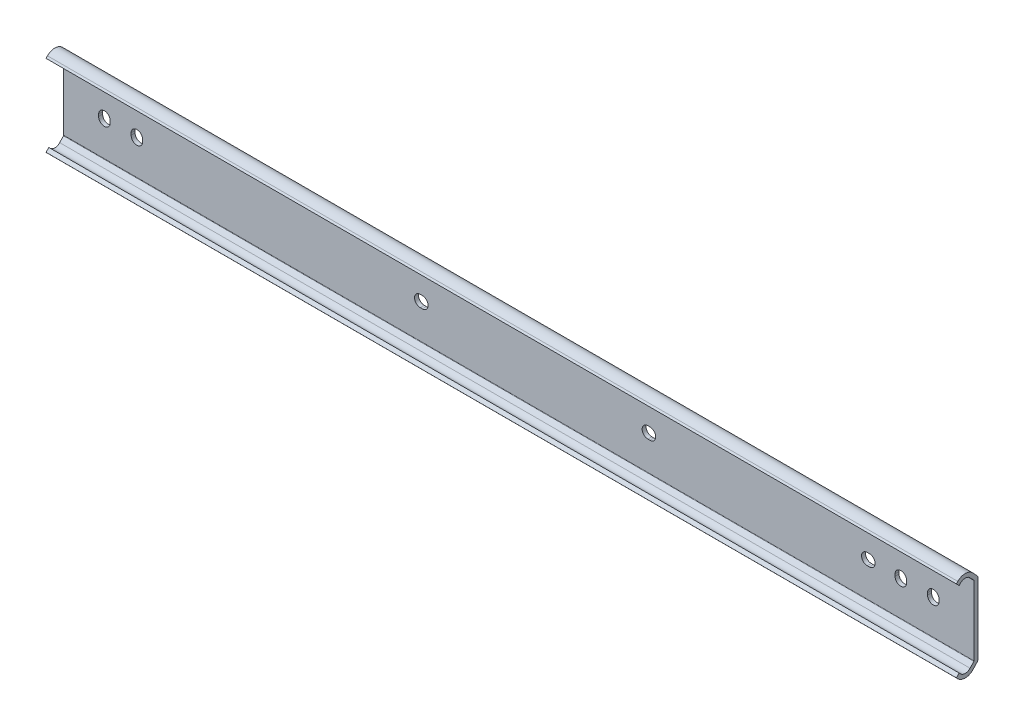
ISO-10303-21;
HEADER;
FILE_DESCRIPTION(('STEP AP214'),'2;1');
FILE_NAME('part.step','',(''),(''),'','','');
FILE_SCHEMA(('AUTOMOTIVE_DESIGN { 1 0 10303 214 1 1 1 1 }'));
ENDSEC;
DATA;
#1=APPLICATION_CONTEXT('core data for automotive mechanical design processes');
#2=APPLICATION_PROTOCOL_DEFINITION('international standard','automotive_design',2000,#1);
#3=PRODUCT_CONTEXT('',#1,'mechanical');
#4=PRODUCT('Part','Part','',(#3));
#5=PRODUCT_RELATED_PRODUCT_CATEGORY('part','',(#4));
#6=PRODUCT_DEFINITION_FORMATION('','',#4);
#7=PRODUCT_DEFINITION_CONTEXT('part definition',#1,'design');
#8=PRODUCT_DEFINITION('design','',#6,#7);
#9=PRODUCT_DEFINITION_SHAPE('','',#8);
#10=(LENGTH_UNIT() NAMED_UNIT(*) SI_UNIT(.MILLI.,.METRE.));
#11=(NAMED_UNIT(*) PLANE_ANGLE_UNIT() SI_UNIT($,.RADIAN.));
#12=(NAMED_UNIT(*) SI_UNIT($,.STERADIAN.) SOLID_ANGLE_UNIT());
#13=UNCERTAINTY_MEASURE_WITH_UNIT(LENGTH_MEASURE(1.E-05),#10,'distance_accuracy_value','');
#14=(GEOMETRIC_REPRESENTATION_CONTEXT(3) GLOBAL_UNCERTAINTY_ASSIGNED_CONTEXT((#13)) GLOBAL_UNIT_ASSIGNED_CONTEXT((#10,
#11,#12)) REPRESENTATION_CONTEXT('',''));
#15=CARTESIAN_POINT('',(0.,0.,0.));
#16=DIRECTION('',(0.,0.,1.));
#17=DIRECTION('',(1.,0.,0.));
#18=AXIS2_PLACEMENT_3D('',#15,#16,#17);
#19=CARTESIAN_POINT('',(-15.9,13.5610179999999,1.54999923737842));
#20=DIRECTION('',(0.,0.,-1.));
#21=DIRECTION('',(1.,0.,0.));
#22=AXIS2_PLACEMENT_3D('',#19,#20,#21);
#23=PLANE('',#22);
#24=DIRECTION('',(1.,0.,0.));
#25=VECTOR('',#24,1.);
#26=CARTESIAN_POINT('',(-15.9,13.5610179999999,1.54999923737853));
#27=LINE('',#26,#25);
#28=CARTESIAN_POINT('',(-15.9,13.5610179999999,1.54999923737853));
#29=VERTEX_POINT('',#28);
#30=CARTESIAN_POINT('',(339.7,13.5610179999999,1.54999923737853));
#31=VERTEX_POINT('',#30);
#32=EDGE_CURVE('E652',#29,#31,#27,.T.);
#33=ORIENTED_EDGE('',*,*,#32,.F.);
#34=DIRECTION('',(0.,1.,0.));
#35=VECTOR('',#34,1.);
#36=CARTESIAN_POINT('',(-15.9,13.5610179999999,1.54999923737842));
#37=LINE('',#36,#35);
#38=CARTESIAN_POINT('',(-15.9,-13.561018,1.54999923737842));
#39=VERTEX_POINT('',#38);
#40=EDGE_CURVE('E600',#39,#29,#37,.T.);
#41=ORIENTED_EDGE('',*,*,#40,.F.);
#42=DIRECTION('',(1.,0.,0.));
#43=VECTOR('',#42,1.);
#44=CARTESIAN_POINT('',(-15.9,-13.561018,1.54999923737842));
#45=LINE('',#44,#43);
#46=CARTESIAN_POINT('',(339.7,-13.561018,1.54999923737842));
#47=VERTEX_POINT('',#46);
#48=EDGE_CURVE('E655',#39,#47,#45,.T.);
#49=ORIENTED_EDGE('',*,*,#48,.T.);
#50=DIRECTION('',(0.,1.,0.));
#51=VECTOR('',#50,1.);
#52=CARTESIAN_POINT('',(339.7,13.5610179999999,1.54999923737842));
#53=LINE('',#52,#51);
#54=EDGE_CURVE('E559',#47,#31,#53,.T.);
#55=ORIENTED_EDGE('',*,*,#54,.T.);
#56=EDGE_LOOP('',(#33,#41,#49,#55));
#57=FACE_BOUND('',#56,.T.);
#58=DIRECTION('',(0.,1.,0.));
#59=VECTOR('',#58,1.);
#60=CARTESIAN_POINT('',(326.05,-0.399999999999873,1.54999923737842));
#61=LINE('',#60,#59);
#62=CARTESIAN_POINT('',(326.05,-0.399999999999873,1.54999923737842));
#63=VERTEX_POINT('',#62);
#64=CARTESIAN_POINT('',(326.05,0.400000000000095,1.54999923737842));
#65=VERTEX_POINT('',#64);
#66=EDGE_CURVE('E338',#63,#65,#61,.T.);
#67=ORIENTED_EDGE('',*,*,#66,.F.);
#68=CARTESIAN_POINT('',(323.8,-0.399999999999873,1.54999923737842));
#69=DIRECTION('',(0.,0.,-1.));
#70=DIRECTION('',(1.,0.,0.));
#71=AXIS2_PLACEMENT_3D('',#68,#69,#70);
#72=CIRCLE('',#71,2.24999999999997);
#73=CARTESIAN_POINT('',(321.55,-0.399999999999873,1.54999923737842));
#74=VERTEX_POINT('',#73);
#75=EDGE_CURVE('E321',#74,#63,#72,.F.);
#76=ORIENTED_EDGE('',*,*,#75,.F.);
#77=DIRECTION('',(0.,-1.,0.));
#78=VECTOR('',#77,1.);
#79=CARTESIAN_POINT('',(321.55,-0.399999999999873,1.54999923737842));
#80=LINE('',#79,#78);
#81=CARTESIAN_POINT('',(321.55,0.400000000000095,1.54999923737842));
#82=VERTEX_POINT('',#81);
#83=EDGE_CURVE('E330',#82,#74,#80,.T.);
#84=ORIENTED_EDGE('',*,*,#83,.F.);
#85=CARTESIAN_POINT('',(323.8,0.400000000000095,1.54999923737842));
#86=DIRECTION('',(0.,0.,-1.));
#87=DIRECTION('',(1.,0.,0.));
#88=AXIS2_PLACEMENT_3D('',#85,#86,#87);
#89=CIRCLE('',#88,2.24999999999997);
#90=EDGE_CURVE('E29',#65,#82,#89,.F.);
#91=ORIENTED_EDGE('',*,*,#90,.F.);
#92=EDGE_LOOP('',(#67,#76,#84,#91));
#93=FACE_BOUND('',#92,.T.);
#94=DIRECTION('',(0.,1.,0.));
#95=VECTOR('',#94,1.);
#96=CARTESIAN_POINT('',(313.35,-0.399999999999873,1.54999923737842));
#97=LINE('',#96,#95);
#98=CARTESIAN_POINT('',(313.35,-0.399999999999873,1.54999923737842));
#99=VERTEX_POINT('',#98);
#100=CARTESIAN_POINT('',(313.35,0.400000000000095,1.54999923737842));
#101=VERTEX_POINT('',#100);
#102=EDGE_CURVE('E356',#99,#101,#97,.T.);
#103=ORIENTED_EDGE('',*,*,#102,.F.);
#104=CARTESIAN_POINT('',(311.1,-0.399999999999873,1.54999923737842));
#105=DIRECTION('',(0.,0.,-1.));
#106=DIRECTION('',(1.,0.,0.));
#107=AXIS2_PLACEMENT_3D('',#104,#105,#106);
#108=CIRCLE('',#107,2.24999999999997);
#109=CARTESIAN_POINT('',(308.85,-0.399999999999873,1.54999923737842));
#110=VERTEX_POINT('',#109);
#111=EDGE_CURVE('E359',#110,#99,#108,.F.);
#112=ORIENTED_EDGE('',*,*,#111,.F.);
#113=DIRECTION('',(0.,-1.,0.));
#114=VECTOR('',#113,1.);
#115=CARTESIAN_POINT('',(308.85,-0.399999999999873,1.54999923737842));
#116=LINE('',#115,#114);
#117=CARTESIAN_POINT('',(308.85,0.400000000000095,1.54999923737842));
#118=VERTEX_POINT('',#117);
#119=EDGE_CURVE('E376',#118,#110,#116,.T.);
#120=ORIENTED_EDGE('',*,*,#119,.F.);
#121=CARTESIAN_POINT('',(311.1,0.400000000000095,1.54999923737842));
#122=DIRECTION('',(0.,0.,-1.));
#123=DIRECTION('',(1.,0.,0.));
#124=AXIS2_PLACEMENT_3D('',#121,#122,#123);
#125=CIRCLE('',#124,2.24999999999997);
#126=EDGE_CURVE('E333',#101,#118,#125,.F.);
#127=ORIENTED_EDGE('',*,*,#126,.F.);
#128=EDGE_LOOP('',(#103,#112,#120,#127));
#129=FACE_BOUND('',#128,.T.);
#130=DIRECTION('',(-1.,0.,0.));
#131=VECTOR('',#130,1.);
#132=CARTESIAN_POINT('',(298.,2.25000000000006,1.54999923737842));
#133=LINE('',#132,#131);
#134=CARTESIAN_POINT('',(298.8,2.25000000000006,1.54999923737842));
#135=VERTEX_POINT('',#134);
#136=CARTESIAN_POINT('',(298.,2.25000000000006,1.54999923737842));
#137=VERTEX_POINT('',#136);
#138=EDGE_CURVE('E387',#135,#137,#133,.T.);
#139=ORIENTED_EDGE('',*,*,#138,.F.);
#140=CARTESIAN_POINT('',(298.8,0.,1.54999923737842));
#141=DIRECTION('',(0.,0.,-1.));
#142=DIRECTION('',(1.,0.,0.));
#143=AXIS2_PLACEMENT_3D('',#140,#141,#142);
#144=CIRCLE('',#143,2.25);
#145=CARTESIAN_POINT('',(298.8,-2.24999999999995,1.54999923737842));
#146=VERTEX_POINT('',#145);
#147=EDGE_CURVE('E390',#146,#135,#144,.F.);
#148=ORIENTED_EDGE('',*,*,#147,.F.);
#149=DIRECTION('',(1.,0.,0.));
#150=VECTOR('',#149,1.);
#151=CARTESIAN_POINT('',(298.,-2.24999999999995,1.54999923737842));
#152=LINE('',#151,#150);
#153=CARTESIAN_POINT('',(298.,-2.24999999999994,1.54999923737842));
#154=VERTEX_POINT('',#153);
#155=EDGE_CURVE('E407',#154,#146,#152,.T.);
#156=ORIENTED_EDGE('',*,*,#155,.F.);
#157=CARTESIAN_POINT('',(298.,0.,1.54999923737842));
#158=DIRECTION('',(0.,0.,-1.));
#159=DIRECTION('',(1.,0.,0.));
#160=AXIS2_PLACEMENT_3D('',#157,#158,#159);
#161=CIRCLE('',#160,2.25);
#162=EDGE_CURVE('E385',#137,#154,#161,.F.);
#163=ORIENTED_EDGE('',*,*,#162,.F.);
#164=EDGE_LOOP('',(#139,#148,#156,#163));
#165=FACE_BOUND('',#164,.T.);
#166=DIRECTION('',(1.,0.,0.));
#167=VECTOR('',#166,1.);
#168=CARTESIAN_POINT('',(212.3,-2.24999999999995,1.54999923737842));
#169=LINE('',#168,#167);
#170=CARTESIAN_POINT('',(212.3,-2.24999999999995,1.54999923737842));
#171=VERTEX_POINT('',#170);
#172=CARTESIAN_POINT('',(213.1,-2.24999999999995,1.54999923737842));
#173=VERTEX_POINT('',#172);
#174=EDGE_CURVE('E418',#171,#173,#169,.T.);
#175=ORIENTED_EDGE('',*,*,#174,.F.);
#176=CARTESIAN_POINT('',(212.3,0.,1.54999923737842));
#177=DIRECTION('',(0.,0.,-1.));
#178=DIRECTION('',(1.,0.,0.));
#179=AXIS2_PLACEMENT_3D('',#176,#177,#178);
#180=CIRCLE('',#179,2.25);
#181=CARTESIAN_POINT('',(212.3,2.25000000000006,1.54999923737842));
#182=VERTEX_POINT('',#181);
#183=EDGE_CURVE('E421',#182,#171,#180,.F.);
#184=ORIENTED_EDGE('',*,*,#183,.F.);
#185=DIRECTION('',(-1.,0.,0.));
#186=VECTOR('',#185,1.);
#187=CARTESIAN_POINT('',(212.3,2.25000000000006,1.54999923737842));
#188=LINE('',#187,#186);
#189=CARTESIAN_POINT('',(213.1,2.25000000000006,1.54999923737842));
#190=VERTEX_POINT('',#189);
#191=EDGE_CURVE('E438',#190,#182,#188,.T.);
#192=ORIENTED_EDGE('',*,*,#191,.F.);
#193=CARTESIAN_POINT('',(213.1,0.,1.54999923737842));
#194=DIRECTION('',(0.,0.,-1.));
#195=DIRECTION('',(1.,0.,0.));
#196=AXIS2_PLACEMENT_3D('',#193,#194,#195);
#197=CIRCLE('',#196,2.25);
#198=EDGE_CURVE('E416',#173,#190,#197,.F.);
#199=ORIENTED_EDGE('',*,*,#198,.F.);
#200=EDGE_LOOP('',(#175,#184,#192,#199));
#201=FACE_BOUND('',#200,.T.);
#202=DIRECTION('',(-1.,0.,0.));
#203=VECTOR('',#202,1.);
#204=CARTESIAN_POINT('',(123.4,2.24999999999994,1.54999923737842));
#205=LINE('',#204,#203);
#206=CARTESIAN_POINT('',(124.2,2.24999999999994,1.54999923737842));
#207=VERTEX_POINT('',#206);
#208=CARTESIAN_POINT('',(123.4,2.24999999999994,1.54999923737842));
#209=VERTEX_POINT('',#208);
#210=EDGE_CURVE('E449',#207,#209,#205,.T.);
#211=ORIENTED_EDGE('',*,*,#210,.F.);
#212=CARTESIAN_POINT('',(124.2,0.,1.54999923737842));
#213=DIRECTION('',(0.,0.,-1.));
#214=DIRECTION('',(1.,0.,0.));
#215=AXIS2_PLACEMENT_3D('',#212,#213,#214);
#216=CIRCLE('',#215,2.25);
#217=CARTESIAN_POINT('',(124.2,-2.25000000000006,1.54999923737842));
#218=VERTEX_POINT('',#217);
#219=EDGE_CURVE('E452',#218,#207,#216,.F.);
#220=ORIENTED_EDGE('',*,*,#219,.F.);
#221=DIRECTION('',(1.,0.,0.));
#222=VECTOR('',#221,1.);
#223=CARTESIAN_POINT('',(123.4,-2.25000000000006,1.54999923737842));
#224=LINE('',#223,#222);
#225=CARTESIAN_POINT('',(123.4,-2.25000000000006,1.54999923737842));
#226=VERTEX_POINT('',#225);
#227=EDGE_CURVE('E469',#226,#218,#224,.T.);
#228=ORIENTED_EDGE('',*,*,#227,.F.);
#229=CARTESIAN_POINT('',(123.4,0.,1.54999923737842));
#230=DIRECTION('',(0.,0.,-1.));
#231=DIRECTION('',(1.,0.,0.));
#232=AXIS2_PLACEMENT_3D('',#229,#230,#231);
#233=CIRCLE('',#232,2.25);
#234=EDGE_CURVE('E447',#209,#226,#233,.F.);
#235=ORIENTED_EDGE('',*,*,#234,.F.);
#236=EDGE_LOOP('',(#211,#220,#228,#235));
#237=FACE_BOUND('',#236,.T.);
#238=DIRECTION('',(0.,1.,0.));
#239=VECTOR('',#238,1.);
#240=CARTESIAN_POINT('',(14.95,-0.399999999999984,1.54999923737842));
#241=LINE('',#240,#239);
#242=CARTESIAN_POINT('',(14.95,-0.399999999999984,1.54999923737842));
#243=VERTEX_POINT('',#242);
#244=CARTESIAN_POINT('',(14.95,0.399999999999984,1.54999923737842));
#245=VERTEX_POINT('',#244);
#246=EDGE_CURVE('E480',#243,#245,#241,.T.);
#247=ORIENTED_EDGE('',*,*,#246,.F.);
#248=CARTESIAN_POINT('',(12.7,-0.399999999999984,1.54999923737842));
#249=DIRECTION('',(0.,0.,-1.));
#250=DIRECTION('',(1.,0.,0.));
#251=AXIS2_PLACEMENT_3D('',#248,#249,#250);
#252=CIRCLE('',#251,2.24999999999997);
#253=CARTESIAN_POINT('',(10.45,-0.399999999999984,1.54999923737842));
#254=VERTEX_POINT('',#253);
#255=EDGE_CURVE('E483',#254,#243,#252,.F.);
#256=ORIENTED_EDGE('',*,*,#255,.F.);
#257=DIRECTION('',(0.,-1.,0.));
#258=VECTOR('',#257,1.);
#259=CARTESIAN_POINT('',(10.45,-0.399999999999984,1.54999923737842));
#260=LINE('',#259,#258);
#261=CARTESIAN_POINT('',(10.45,0.399999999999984,1.54999923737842));
#262=VERTEX_POINT('',#261);
#263=EDGE_CURVE('E500',#262,#254,#260,.T.);
#264=ORIENTED_EDGE('',*,*,#263,.F.);
#265=CARTESIAN_POINT('',(12.7,0.399999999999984,1.54999923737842));
#266=DIRECTION('',(0.,0.,-1.));
#267=DIRECTION('',(1.,0.,0.));
#268=AXIS2_PLACEMENT_3D('',#265,#266,#267);
#269=CIRCLE('',#268,2.24999999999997);
#270=EDGE_CURVE('E478',#245,#262,#269,.F.);
#271=ORIENTED_EDGE('',*,*,#270,.F.);
#272=EDGE_LOOP('',(#247,#256,#264,#271));
#273=FACE_BOUND('',#272,.T.);
#274=DIRECTION('',(0.,1.,0.));
#275=VECTOR('',#274,1.);
#276=CARTESIAN_POINT('',(2.24999999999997,-0.399999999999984,1.54999923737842));
#277=LINE('',#276,#275);
#278=CARTESIAN_POINT('',(2.24999999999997,-0.399999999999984,1.54999923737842));
#279=VERTEX_POINT('',#278);
#280=CARTESIAN_POINT('',(2.24999999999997,0.399999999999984,1.54999923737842));
#281=VERTEX_POINT('',#280);
#282=EDGE_CURVE('E511',#279,#281,#277,.T.);
#283=ORIENTED_EDGE('',*,*,#282,.F.);
#284=CARTESIAN_POINT('',(0.,-0.399999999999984,1.54999923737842));
#285=DIRECTION('',(0.,0.,-1.));
#286=DIRECTION('',(1.,0.,0.));
#287=AXIS2_PLACEMENT_3D('',#284,#285,#286);
#288=CIRCLE('',#287,2.24999999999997);
#289=CARTESIAN_POINT('',(-2.24999999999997,-0.399999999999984,1.54999923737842));
#290=VERTEX_POINT('',#289);
#291=EDGE_CURVE('E514',#290,#279,#288,.F.);
#292=ORIENTED_EDGE('',*,*,#291,.F.);
#293=DIRECTION('',(0.,-1.,0.));
#294=VECTOR('',#293,1.);
#295=CARTESIAN_POINT('',(-2.24999999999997,-0.399999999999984,1.54999923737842));
#296=LINE('',#295,#294);
#297=CARTESIAN_POINT('',(-2.24999999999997,0.399999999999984,1.54999923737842));
#298=VERTEX_POINT('',#297);
#299=EDGE_CURVE('E531',#298,#290,#296,.T.);
#300=ORIENTED_EDGE('',*,*,#299,.F.);
#301=CARTESIAN_POINT('',(0.,0.399999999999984,1.54999923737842));
#302=DIRECTION('',(0.,0.,-1.));
#303=DIRECTION('',(1.,0.,0.));
#304=AXIS2_PLACEMENT_3D('',#301,#302,#303);
#305=CIRCLE('',#304,2.24999999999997);
#306=EDGE_CURVE('E509',#281,#298,#305,.F.);
#307=ORIENTED_EDGE('',*,*,#306,.F.);
#308=EDGE_LOOP('',(#283,#292,#300,#307));
#309=FACE_BOUND('',#308,.T.);
#310=ADVANCED_FACE('F14',(#57,#93,#129,#165,#201,#237,#273,#309),#23,.F.);
#311=CARTESIAN_POINT('',(-15.9,13.5610176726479,0.));
#312=DIRECTION('',(0.,0.,1.));
#313=DIRECTION('',(-1.,0.,0.));
#314=AXIS2_PLACEMENT_3D('',#311,#312,#313);
#315=PLANE('',#314);
#316=DIRECTION('',(0.,1.,0.));
#317=VECTOR('',#316,1.);
#318=CARTESIAN_POINT('',(321.55,-0.399999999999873,0.));
#319=LINE('',#318,#317);
#320=CARTESIAN_POINT('',(321.55,-0.399999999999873,0.));
#321=VERTEX_POINT('',#320);
#322=CARTESIAN_POINT('',(321.55,0.400000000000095,0.));
#323=VERTEX_POINT('',#322);
#324=EDGE_CURVE('E340',#321,#323,#319,.T.);
#325=ORIENTED_EDGE('',*,*,#324,.F.);
#326=CARTESIAN_POINT('',(323.8,-0.399999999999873,0.));
#327=DIRECTION('',(0.,0.,-1.));
#328=DIRECTION('',(1.,0.,0.));
#329=AXIS2_PLACEMENT_3D('',#326,#327,#328);
#330=CIRCLE('',#329,2.24999999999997);
#331=CARTESIAN_POINT('',(326.05,-0.399999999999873,0.));
#332=VERTEX_POINT('',#331);
#333=EDGE_CURVE('E37',#332,#321,#330,.T.);
#334=ORIENTED_EDGE('',*,*,#333,.F.);
#335=DIRECTION('',(0.,-1.,0.));
#336=VECTOR('',#335,1.);
#337=CARTESIAN_POINT('',(326.05,-0.399999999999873,0.));
#338=LINE('',#337,#336);
#339=CARTESIAN_POINT('',(326.05,0.400000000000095,0.));
#340=VERTEX_POINT('',#339);
#341=EDGE_CURVE('E327',#340,#332,#338,.T.);
#342=ORIENTED_EDGE('',*,*,#341,.F.);
#343=CARTESIAN_POINT('',(323.8,0.400000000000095,0.));
#344=DIRECTION('',(0.,0.,-1.));
#345=DIRECTION('',(1.,0.,0.));
#346=AXIS2_PLACEMENT_3D('',#343,#344,#345);
#347=CIRCLE('',#346,2.24999999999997);
#348=EDGE_CURVE('E346',#323,#340,#347,.T.);
#349=ORIENTED_EDGE('',*,*,#348,.F.);
#350=EDGE_LOOP('',(#325,#334,#342,#349));
#351=FACE_BOUND('',#350,.T.);
#352=DIRECTION('',(0.,1.,0.));
#353=VECTOR('',#352,1.);
#354=CARTESIAN_POINT('',(308.85,-0.399999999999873,0.));
#355=LINE('',#354,#353);
#356=CARTESIAN_POINT('',(308.85,-0.399999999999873,0.));
#357=VERTEX_POINT('',#356);
#358=CARTESIAN_POINT('',(308.85,0.400000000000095,0.));
#359=VERTEX_POINT('',#358);
#360=EDGE_CURVE('E364',#357,#359,#355,.T.);
#361=ORIENTED_EDGE('',*,*,#360,.F.);
#362=CARTESIAN_POINT('',(311.1,-0.399999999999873,0.));
#363=DIRECTION('',(0.,0.,-1.));
#364=DIRECTION('',(1.,0.,0.));
#365=AXIS2_PLACEMENT_3D('',#362,#363,#364);
#366=CIRCLE('',#365,2.24999999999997);
#367=CARTESIAN_POINT('',(313.35,-0.399999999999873,0.));
#368=VERTEX_POINT('',#367);
#369=EDGE_CURVE('E362',#368,#357,#366,.T.);
#370=ORIENTED_EDGE('',*,*,#369,.F.);
#371=DIRECTION('',(0.,-1.,0.));
#372=VECTOR('',#371,1.);
#373=CARTESIAN_POINT('',(313.35,-0.399999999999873,0.));
#374=LINE('',#373,#372);
#375=CARTESIAN_POINT('',(313.35,0.400000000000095,0.));
#376=VERTEX_POINT('',#375);
#377=EDGE_CURVE('E370',#376,#368,#374,.T.);
#378=ORIENTED_EDGE('',*,*,#377,.F.);
#379=CARTESIAN_POINT('',(311.1,0.400000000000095,0.));
#380=DIRECTION('',(0.,0.,-1.));
#381=DIRECTION('',(1.,0.,0.));
#382=AXIS2_PLACEMENT_3D('',#379,#380,#381);
#383=CIRCLE('',#382,2.24999999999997);
#384=EDGE_CURVE('E367',#359,#376,#383,.T.);
#385=ORIENTED_EDGE('',*,*,#384,.F.);
#386=EDGE_LOOP('',(#361,#370,#378,#385));
#387=FACE_BOUND('',#386,.T.);
#388=DIRECTION('',(-1.,0.,0.));
#389=VECTOR('',#388,1.);
#390=CARTESIAN_POINT('',(298.,-2.24999999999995,0.));
#391=LINE('',#390,#389);
#392=CARTESIAN_POINT('',(298.8,-2.24999999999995,0.));
#393=VERTEX_POINT('',#392);
#394=CARTESIAN_POINT('',(298.,-2.24999999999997,0.));
#395=VERTEX_POINT('',#394);
#396=EDGE_CURVE('E395',#393,#395,#391,.T.);
#397=ORIENTED_EDGE('',*,*,#396,.F.);
#398=CARTESIAN_POINT('',(298.8,0.,0.));
#399=DIRECTION('',(0.,0.,-1.));
#400=DIRECTION('',(1.,0.,0.));
#401=AXIS2_PLACEMENT_3D('',#398,#399,#400);
#402=CIRCLE('',#401,2.25);
#403=CARTESIAN_POINT('',(298.8,2.25000000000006,0.));
#404=VERTEX_POINT('',#403);
#405=EDGE_CURVE('E393',#404,#393,#402,.T.);
#406=ORIENTED_EDGE('',*,*,#405,.F.);
#407=DIRECTION('',(1.,0.,0.));
#408=VECTOR('',#407,1.);
#409=CARTESIAN_POINT('',(298.,2.25000000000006,0.));
#410=LINE('',#409,#408);
#411=CARTESIAN_POINT('',(298.,2.25000000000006,0.));
#412=VERTEX_POINT('',#411);
#413=EDGE_CURVE('E401',#412,#404,#410,.T.);
#414=ORIENTED_EDGE('',*,*,#413,.F.);
#415=CARTESIAN_POINT('',(298.,0.,0.));
#416=DIRECTION('',(0.,0.,-1.));
#417=DIRECTION('',(1.,0.,0.));
#418=AXIS2_PLACEMENT_3D('',#415,#416,#417);
#419=CIRCLE('',#418,2.25);
#420=EDGE_CURVE('E398',#395,#412,#419,.T.);
#421=ORIENTED_EDGE('',*,*,#420,.F.);
#422=EDGE_LOOP('',(#397,#406,#414,#421));
#423=FACE_BOUND('',#422,.T.);
#424=DIRECTION('',(1.,0.,0.));
#425=VECTOR('',#424,1.);
#426=CARTESIAN_POINT('',(212.3,2.25000000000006,0.));
#427=LINE('',#426,#425);
#428=CARTESIAN_POINT('',(212.3,2.25000000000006,0.));
#429=VERTEX_POINT('',#428);
#430=CARTESIAN_POINT('',(213.1,2.25000000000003,0.));
#431=VERTEX_POINT('',#430);
#432=EDGE_CURVE('E426',#429,#431,#427,.T.);
#433=ORIENTED_EDGE('',*,*,#432,.F.);
#434=CARTESIAN_POINT('',(212.3,0.,0.));
#435=DIRECTION('',(0.,0.,-1.));
#436=DIRECTION('',(1.,0.,0.));
#437=AXIS2_PLACEMENT_3D('',#434,#435,#436);
#438=CIRCLE('',#437,2.25);
#439=CARTESIAN_POINT('',(212.3,-2.24999999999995,0.));
#440=VERTEX_POINT('',#439);
#441=EDGE_CURVE('E424',#440,#429,#438,.T.);
#442=ORIENTED_EDGE('',*,*,#441,.F.);
#443=DIRECTION('',(-1.,0.,0.));
#444=VECTOR('',#443,1.);
#445=CARTESIAN_POINT('',(212.3,-2.24999999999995,0.));
#446=LINE('',#445,#444);
#447=CARTESIAN_POINT('',(213.1,-2.24999999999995,0.));
#448=VERTEX_POINT('',#447);
#449=EDGE_CURVE('E432',#448,#440,#446,.T.);
#450=ORIENTED_EDGE('',*,*,#449,.F.);
#451=CARTESIAN_POINT('',(213.1,0.,0.));
#452=DIRECTION('',(0.,0.,-1.));
#453=DIRECTION('',(1.,0.,0.));
#454=AXIS2_PLACEMENT_3D('',#451,#452,#453);
#455=CIRCLE('',#454,2.25);
#456=EDGE_CURVE('E429',#431,#448,#455,.T.);
#457=ORIENTED_EDGE('',*,*,#456,.F.);
#458=EDGE_LOOP('',(#433,#442,#450,#457));
#459=FACE_BOUND('',#458,.T.);
#460=DIRECTION('',(-1.,0.,0.));
#461=VECTOR('',#460,1.);
#462=CARTESIAN_POINT('',(123.4,-2.25000000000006,0.));
#463=LINE('',#462,#461);
#464=CARTESIAN_POINT('',(124.2,-2.25000000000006,0.));
#465=VERTEX_POINT('',#464);
#466=CARTESIAN_POINT('',(123.4,-2.25000000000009,0.));
#467=VERTEX_POINT('',#466);
#468=EDGE_CURVE('E457',#465,#467,#463,.T.);
#469=ORIENTED_EDGE('',*,*,#468,.F.);
#470=CARTESIAN_POINT('',(124.2,0.,0.));
#471=DIRECTION('',(0.,0.,-1.));
#472=DIRECTION('',(1.,0.,0.));
#473=AXIS2_PLACEMENT_3D('',#470,#471,#472);
#474=CIRCLE('',#473,2.25);
#475=CARTESIAN_POINT('',(124.2,2.24999999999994,0.));
#476=VERTEX_POINT('',#475);
#477=EDGE_CURVE('E455',#476,#465,#474,.T.);
#478=ORIENTED_EDGE('',*,*,#477,.F.);
#479=DIRECTION('',(1.,0.,0.));
#480=VECTOR('',#479,1.);
#481=CARTESIAN_POINT('',(123.4,2.24999999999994,0.));
#482=LINE('',#481,#480);
#483=CARTESIAN_POINT('',(123.4,2.24999999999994,0.));
#484=VERTEX_POINT('',#483);
#485=EDGE_CURVE('E463',#484,#476,#482,.T.);
#486=ORIENTED_EDGE('',*,*,#485,.F.);
#487=CARTESIAN_POINT('',(123.4,0.,0.));
#488=DIRECTION('',(0.,0.,-1.));
#489=DIRECTION('',(1.,0.,0.));
#490=AXIS2_PLACEMENT_3D('',#487,#488,#489);
#491=CIRCLE('',#490,2.25);
#492=EDGE_CURVE('E460',#467,#484,#491,.T.);
#493=ORIENTED_EDGE('',*,*,#492,.F.);
#494=EDGE_LOOP('',(#469,#478,#486,#493));
#495=FACE_BOUND('',#494,.T.);
#496=DIRECTION('',(0.,1.,0.));
#497=VECTOR('',#496,1.);
#498=CARTESIAN_POINT('',(10.45,-0.399999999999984,0.));
#499=LINE('',#498,#497);
#500=CARTESIAN_POINT('',(10.45,-0.399999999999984,0.));
#501=VERTEX_POINT('',#500);
#502=CARTESIAN_POINT('',(10.45,0.399999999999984,0.));
#503=VERTEX_POINT('',#502);
#504=EDGE_CURVE('E488',#501,#503,#499,.T.);
#505=ORIENTED_EDGE('',*,*,#504,.F.);
#506=CARTESIAN_POINT('',(12.7,-0.399999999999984,0.));
#507=DIRECTION('',(0.,0.,-1.));
#508=DIRECTION('',(1.,0.,0.));
#509=AXIS2_PLACEMENT_3D('',#506,#507,#508);
#510=CIRCLE('',#509,2.24999999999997);
#511=CARTESIAN_POINT('',(14.95,-0.399999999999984,0.));
#512=VERTEX_POINT('',#511);
#513=EDGE_CURVE('E486',#512,#501,#510,.T.);
#514=ORIENTED_EDGE('',*,*,#513,.F.);
#515=DIRECTION('',(0.,-1.,0.));
#516=VECTOR('',#515,1.);
#517=CARTESIAN_POINT('',(14.95,-0.399999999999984,0.));
#518=LINE('',#517,#516);
#519=CARTESIAN_POINT('',(14.95,0.399999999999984,0.));
#520=VERTEX_POINT('',#519);
#521=EDGE_CURVE('E494',#520,#512,#518,.T.);
#522=ORIENTED_EDGE('',*,*,#521,.F.);
#523=CARTESIAN_POINT('',(12.7,0.399999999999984,0.));
#524=DIRECTION('',(0.,0.,-1.));
#525=DIRECTION('',(1.,0.,0.));
#526=AXIS2_PLACEMENT_3D('',#523,#524,#525);
#527=CIRCLE('',#526,2.24999999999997);
#528=EDGE_CURVE('E491',#503,#520,#527,.T.);
#529=ORIENTED_EDGE('',*,*,#528,.F.);
#530=EDGE_LOOP('',(#505,#514,#522,#529));
#531=FACE_BOUND('',#530,.T.);
#532=DIRECTION('',(0.,1.,0.));
#533=VECTOR('',#532,1.);
#534=CARTESIAN_POINT('',(-2.24999999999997,-0.399999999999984,0.));
#535=LINE('',#534,#533);
#536=CARTESIAN_POINT('',(-2.24999999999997,-0.399999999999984,0.));
#537=VERTEX_POINT('',#536);
#538=CARTESIAN_POINT('',(-2.24999999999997,0.399999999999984,0.));
#539=VERTEX_POINT('',#538);
#540=EDGE_CURVE('E519',#537,#539,#535,.T.);
#541=ORIENTED_EDGE('',*,*,#540,.F.);
#542=CARTESIAN_POINT('',(0.,-0.399999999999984,0.));
#543=DIRECTION('',(0.,0.,-1.));
#544=DIRECTION('',(1.,0.,0.));
#545=AXIS2_PLACEMENT_3D('',#542,#543,#544);
#546=CIRCLE('',#545,2.24999999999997);
#547=CARTESIAN_POINT('',(2.24999999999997,-0.399999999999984,0.));
#548=VERTEX_POINT('',#547);
#549=EDGE_CURVE('E517',#548,#537,#546,.T.);
#550=ORIENTED_EDGE('',*,*,#549,.F.);
#551=DIRECTION('',(0.,-1.,0.));
#552=VECTOR('',#551,1.);
#553=CARTESIAN_POINT('',(2.24999999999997,-0.399999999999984,0.));
#554=LINE('',#553,#552);
#555=CARTESIAN_POINT('',(2.24999999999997,0.399999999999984,0.));
#556=VERTEX_POINT('',#555);
#557=EDGE_CURVE('E525',#556,#548,#554,.T.);
#558=ORIENTED_EDGE('',*,*,#557,.F.);
#559=CARTESIAN_POINT('',(0.,0.399999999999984,0.));
#560=DIRECTION('',(0.,0.,-1.));
#561=DIRECTION('',(1.,0.,0.));
#562=AXIS2_PLACEMENT_3D('',#559,#560,#561);
#563=CIRCLE('',#562,2.24999999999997);
#564=EDGE_CURVE('E522',#539,#556,#563,.T.);
#565=ORIENTED_EDGE('',*,*,#564,.F.);
#566=EDGE_LOOP('',(#541,#550,#558,#565));
#567=FACE_BOUND('',#566,.T.);
#568=DIRECTION('',(1.,0.,0.));
#569=VECTOR('',#568,1.);
#570=CARTESIAN_POINT('',(-15.9,-13.561017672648,0.));
#571=LINE('',#570,#569);
#572=CARTESIAN_POINT('',(-15.9,-13.561017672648,0.));
#573=VERTEX_POINT('',#572);
#574=CARTESIAN_POINT('',(339.7,-13.561017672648,0.));
#575=VERTEX_POINT('',#574);
#576=EDGE_CURVE('E622',#573,#575,#571,.T.);
#577=ORIENTED_EDGE('',*,*,#576,.F.);
#578=DIRECTION('',(0.,-1.,0.));
#579=VECTOR('',#578,1.);
#580=CARTESIAN_POINT('',(-15.9,13.5610176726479,0.));
#581=LINE('',#580,#579);
#582=CARTESIAN_POINT('',(-15.9,13.5610176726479,0.));
#583=VERTEX_POINT('',#582);
#584=EDGE_CURVE('E620',#583,#573,#581,.T.);
#585=ORIENTED_EDGE('',*,*,#584,.F.);
#586=DIRECTION('',(1.,0.,0.));
#587=VECTOR('',#586,1.);
#588=CARTESIAN_POINT('',(-15.9,13.5610176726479,0.));
#589=LINE('',#588,#587);
#590=CARTESIAN_POINT('',(339.7,13.5610176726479,0.));
#591=VERTEX_POINT('',#590);
#592=EDGE_CURVE('E625',#583,#591,#589,.T.);
#593=ORIENTED_EDGE('',*,*,#592,.T.);
#594=DIRECTION('',(0.,-1.,0.));
#595=VECTOR('',#594,1.);
#596=CARTESIAN_POINT('',(339.7,13.5610176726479,0.));
#597=LINE('',#596,#595);
#598=EDGE_CURVE('E579',#591,#575,#597,.T.);
#599=ORIENTED_EDGE('',*,*,#598,.T.);
#600=EDGE_LOOP('',(#577,#585,#593,#599));
#601=FACE_BOUND('',#600,.T.);
#602=ADVANCED_FACE('F710',(#351,#387,#423,#459,#495,#531,#567,#601),#315,.F.);
#603=CARTESIAN_POINT('',(-15.9,-13.5610175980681,1.80000204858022));
#604=DIRECTION('',(1.,0.,0.));
#605=DIRECTION('',(0.,0.,1.));
#606=AXIS2_PLACEMENT_3D('',#603,#604,#605);
#607=PLANE('',#606);
#608=ORIENTED_EDGE('',*,*,#40,.T.);
#609=CARTESIAN_POINT('',(-15.9,13.5610175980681,1.80000204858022));
#610=DIRECTION('',(1.,0.,0.));
#611=DIRECTION('',(0.,0.,1.));
#612=AXIS2_PLACEMENT_3D('',#609,#610,#611);
#613=CIRCLE('',#612,0.250002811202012);
#614=CARTESIAN_POINT('',(-15.9,13.7341215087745,1.61962344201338));
#615=VERTEX_POINT('',#614);
#616=EDGE_CURVE('E602',#29,#615,#613,.T.);
#617=ORIENTED_EDGE('',*,*,#616,.T.);
#618=DIRECTION('',(0.,0.72150413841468,0.692410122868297));
#619=VECTOR('',#618,1.);
#620=CARTESIAN_POINT('',(-15.9,13.7341215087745,1.61962344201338));
#621=LINE('',#620,#619);
#622=CARTESIAN_POINT('',(-15.9,15.2920521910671,3.11473194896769));
#623=VERTEX_POINT('',#622);
#624=EDGE_CURVE('E604',#615,#623,#621,.T.);
#625=ORIENTED_EDGE('',*,*,#624,.T.);
#626=CARTESIAN_POINT('',(-15.9,13.5750002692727,4.99999970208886));
#627=DIRECTION('',(1.,0.,0.));
#628=DIRECTION('',(0.,0.,1.));
#629=AXIS2_PLACEMENT_3D('',#626,#627,#628);
#630=CIRCLE('',#629,2.55000035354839);
#631=CARTESIAN_POINT('',(-15.9,15.2920597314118,6.88526058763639));
#632=VERTEX_POINT('',#631);
#633=EDGE_CURVE('E606',#623,#632,#630,.T.);
#634=ORIENTED_EDGE('',*,*,#633,.T.);
#635=DIRECTION('',(0.,-0.721504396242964,0.692409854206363));
#636=VECTOR('',#635,1.);
#637=CARTESIAN_POINT('',(-15.9,15.2920597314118,6.88526058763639));
#638=LINE('',#637,#636);
#639=CARTESIAN_POINT('',(-15.9,14.7934625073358,7.36375196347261));
#640=VERTEX_POINT('',#639);
#641=EDGE_CURVE('E608',#632,#640,#638,.T.);
#642=ORIENTED_EDGE('',*,*,#641,.T.);
#643=DIRECTION('',(0.,0.707106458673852,0.707107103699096));
#644=VECTOR('',#643,1.);
#645=CARTESIAN_POINT('',(-15.9,14.7934625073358,7.36375196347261));
#646=LINE('',#645,#644);
#647=CARTESIAN_POINT('',(-15.9,15.889709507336,8.45999996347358));
#648=VERTEX_POINT('',#647);
#649=EDGE_CURVE('E610',#640,#648,#646,.T.);
#650=ORIENTED_EDGE('',*,*,#649,.T.);
#651=DIRECTION('',(0.,0.721503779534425,-0.692410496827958));
#652=VECTOR('',#651,1.);
#653=CARTESIAN_POINT('',(-15.9,16.4741385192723,7.89913695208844));
#654=LINE('',#653,#652);
#655=CARTESIAN_POINT('',(-15.9,16.4741385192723,7.89913695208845));
#656=VERTEX_POINT('',#655);
#657=EDGE_CURVE('E612',#648,#656,#654,.T.);
#658=ORIENTED_EDGE('',*,*,#657,.T.);
#659=CARTESIAN_POINT('',(-15.9,13.5750002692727,4.99999970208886));
#660=DIRECTION('',(-1.,0.,0.));
#661=DIRECTION('',(0.,0.,-1.));
#662=AXIS2_PLACEMENT_3D('',#659,#660,#661);
#663=CIRCLE('',#662,4.09999992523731);
#664=CARTESIAN_POINT('',(-15.9,16.4741380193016,2.10086195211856));
#665=VERTEX_POINT('',#664);
#666=EDGE_CURVE('E614',#656,#665,#663,.T.);
#667=ORIENTED_EDGE('',*,*,#666,.T.);
#668=DIRECTION('',(0.,-0.721504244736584,-0.692410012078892));
#669=VECTOR('',#668,1.);
#670=CARTESIAN_POINT('',(-15.9,14.8073560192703,0.501291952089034));
#671=LINE('',#670,#669);
#672=CARTESIAN_POINT('',(-15.9,14.8073560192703,0.501291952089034));
#673=VERTEX_POINT('',#672);
#674=EDGE_CURVE('E616',#665,#673,#671,.T.);
#675=ORIENTED_EDGE('',*,*,#674,.T.);
#676=CARTESIAN_POINT('',(-15.9,13.5610175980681,1.80000204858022));
#677=DIRECTION('',(-1.,0.,0.));
#678=DIRECTION('',(0.,0.,-1.));
#679=AXIS2_PLACEMENT_3D('',#676,#677,#678);
#680=CIRCLE('',#679,1.80000204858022);
#681=EDGE_CURVE('E618',#673,#583,#680,.T.);
#682=ORIENTED_EDGE('',*,*,#681,.T.);
#683=ORIENTED_EDGE('',*,*,#584,.T.);
#684=CARTESIAN_POINT('',(-15.9,-13.5610175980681,1.80000204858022));
#685=DIRECTION('',(-1.,0.,0.));
#686=DIRECTION('',(0.,0.,1.));
#687=AXIS2_PLACEMENT_3D('',#684,#685,#686);
#688=CIRCLE('',#687,1.80000204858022);
#689=CARTESIAN_POINT('',(-15.9,-14.8073560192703,0.501291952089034));
#690=VERTEX_POINT('',#689);
#691=EDGE_CURVE('E581',#573,#690,#688,.T.);
#692=ORIENTED_EDGE('',*,*,#691,.T.);
#693=DIRECTION('',(0.,-0.721504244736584,0.692410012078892));
#694=VECTOR('',#693,1.);
#695=CARTESIAN_POINT('',(-15.9,-14.8073560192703,0.501291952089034));
#696=LINE('',#695,#694);
#697=CARTESIAN_POINT('',(-15.9,-16.4741380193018,2.10086195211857));
#698=VERTEX_POINT('',#697);
#699=EDGE_CURVE('E584',#690,#698,#696,.T.);
#700=ORIENTED_EDGE('',*,*,#699,.T.);
#701=CARTESIAN_POINT('',(-15.9,-13.5750002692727,4.99999970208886));
#702=DIRECTION('',(-1.,0.,0.));
#703=DIRECTION('',(0.,0.,1.));
#704=AXIS2_PLACEMENT_3D('',#701,#702,#703);
#705=CIRCLE('',#704,4.09999992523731);
#706=CARTESIAN_POINT('',(-15.9,-16.4741385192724,7.89913695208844));
#707=VERTEX_POINT('',#706);
#708=EDGE_CURVE('E586',#698,#707,#705,.T.);
#709=ORIENTED_EDGE('',*,*,#708,.T.);
#710=DIRECTION('',(0.,0.721503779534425,0.692410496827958));
#711=VECTOR('',#710,1.);
#712=CARTESIAN_POINT('',(-15.9,-16.4741385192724,7.89913695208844));
#713=LINE('',#712,#711);
#714=CARTESIAN_POINT('',(-15.9,-15.8897095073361,8.45999996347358));
#715=VERTEX_POINT('',#714);
#716=EDGE_CURVE('E588',#707,#715,#713,.T.);
#717=ORIENTED_EDGE('',*,*,#716,.T.);
#718=DIRECTION('',(0.,0.707106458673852,-0.707107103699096));
#719=VECTOR('',#718,1.);
#720=CARTESIAN_POINT('',(-15.9,-14.7934625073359,7.36375196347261));
#721=LINE('',#720,#719);
#722=CARTESIAN_POINT('',(-15.9,-14.7934625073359,7.36375196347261));
#723=VERTEX_POINT('',#722);
#724=EDGE_CURVE('E590',#715,#723,#721,.T.);
#725=ORIENTED_EDGE('',*,*,#724,.T.);
#726=DIRECTION('',(0.,-0.721504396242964,-0.692409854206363));
#727=VECTOR('',#726,1.);
#728=CARTESIAN_POINT('',(-15.9,-15.2920597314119,6.88526058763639));
#729=LINE('',#728,#727);
#730=CARTESIAN_POINT('',(-15.9,-15.2920597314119,6.88526058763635));
#731=VERTEX_POINT('',#730);
#732=EDGE_CURVE('E592',#723,#731,#729,.T.);
#733=ORIENTED_EDGE('',*,*,#732,.T.);
#734=CARTESIAN_POINT('',(-15.9,-13.5750002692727,4.99999970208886));
#735=DIRECTION('',(1.,0.,0.));
#736=DIRECTION('',(0.,0.,-1.));
#737=AXIS2_PLACEMENT_3D('',#734,#735,#736);
#738=CIRCLE('',#737,2.55000035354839);
#739=CARTESIAN_POINT('',(-15.9,-15.2920521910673,3.11473194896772));
#740=VERTEX_POINT('',#739);
#741=EDGE_CURVE('E594',#731,#740,#738,.T.);
#742=ORIENTED_EDGE('',*,*,#741,.T.);
#743=DIRECTION('',(0.,0.72150413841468,-0.692410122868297));
#744=VECTOR('',#743,1.);
#745=CARTESIAN_POINT('',(-15.9,-13.7341215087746,1.61962344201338));
#746=LINE('',#745,#744);
#747=CARTESIAN_POINT('',(-15.9,-13.7341215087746,1.6196234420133));
#748=VERTEX_POINT('',#747);
#749=EDGE_CURVE('E596',#740,#748,#746,.T.);
#750=ORIENTED_EDGE('',*,*,#749,.T.);
#751=CARTESIAN_POINT('',(-15.9,-13.5610175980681,1.80000204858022));
#752=DIRECTION('',(1.,0.,0.));
#753=DIRECTION('',(0.,0.,-1.));
#754=AXIS2_PLACEMENT_3D('',#751,#752,#753);
#755=CIRCLE('',#754,0.250002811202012);
#756=EDGE_CURVE('E598',#748,#39,#755,.T.);
#757=ORIENTED_EDGE('',*,*,#756,.T.);
#758=EDGE_LOOP('',(#608,#617,#625,#634,#642,#650,#658,#667,#675,#682,#683,#692,#700,#709,#717,
#725,#733,#742,#750,#757));
#759=FACE_BOUND('',#758,.T.);
#760=ADVANCED_FACE('F699',(#759),#607,.F.);
#761=CARTESIAN_POINT('',(339.7,-13.5610175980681,1.80000204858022));
#762=DIRECTION('',(1.,0.,0.));
#763=DIRECTION('',(0.,0.,1.));
#764=AXIS2_PLACEMENT_3D('',#761,#762,#763);
#765=PLANE('',#764);
#766=CARTESIAN_POINT('',(339.7,-13.5610175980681,1.80000204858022));
#767=DIRECTION('',(-1.,0.,0.));
#768=DIRECTION('',(0.,0.,1.));
#769=AXIS2_PLACEMENT_3D('',#766,#767,#768);
#770=CIRCLE('',#769,1.80000204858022);
#771=CARTESIAN_POINT('',(339.7,-14.8073560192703,0.501291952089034));
#772=VERTEX_POINT('',#771);
#773=EDGE_CURVE('E540',#575,#772,#770,.T.);
#774=ORIENTED_EDGE('',*,*,#773,.F.);
#775=ORIENTED_EDGE('',*,*,#598,.F.);
#776=CARTESIAN_POINT('',(339.7,13.5610175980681,1.80000204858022));
#777=DIRECTION('',(-1.,0.,0.));
#778=DIRECTION('',(0.,0.,-1.));
#779=AXIS2_PLACEMENT_3D('',#776,#777,#778);
#780=CIRCLE('',#779,1.80000204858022);
#781=CARTESIAN_POINT('',(339.7,14.8073560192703,0.501291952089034));
#782=VERTEX_POINT('',#781);
#783=EDGE_CURVE('E577',#782,#591,#780,.T.);
#784=ORIENTED_EDGE('',*,*,#783,.F.);
#785=DIRECTION('',(0.,-0.721504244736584,-0.692410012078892));
#786=VECTOR('',#785,1.);
#787=CARTESIAN_POINT('',(339.7,14.8073560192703,0.501291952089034));
#788=LINE('',#787,#786);
#789=CARTESIAN_POINT('',(339.7,16.4741380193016,2.10086195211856));
#790=VERTEX_POINT('',#789);
#791=EDGE_CURVE('E575',#790,#782,#788,.T.);
#792=ORIENTED_EDGE('',*,*,#791,.F.);
#793=CARTESIAN_POINT('',(339.7,13.5750002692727,4.99999970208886));
#794=DIRECTION('',(-1.,0.,0.));
#795=DIRECTION('',(0.,0.,-1.));
#796=AXIS2_PLACEMENT_3D('',#793,#794,#795);
#797=CIRCLE('',#796,4.09999992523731);
#798=CARTESIAN_POINT('',(339.7,16.4741385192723,7.89913695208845));
#799=VERTEX_POINT('',#798);
#800=EDGE_CURVE('E573',#799,#790,#797,.T.);
#801=ORIENTED_EDGE('',*,*,#800,.F.);
#802=DIRECTION('',(0.,0.721503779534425,-0.692410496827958));
#803=VECTOR('',#802,1.);
#804=CARTESIAN_POINT('',(339.7,16.4741385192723,7.89913695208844));
#805=LINE('',#804,#803);
#806=CARTESIAN_POINT('',(339.7,15.889709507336,8.45999996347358));
#807=VERTEX_POINT('',#806);
#808=EDGE_CURVE('E571',#807,#799,#805,.T.);
#809=ORIENTED_EDGE('',*,*,#808,.F.);
#810=DIRECTION('',(0.,0.707106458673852,0.707107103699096));
#811=VECTOR('',#810,1.);
#812=CARTESIAN_POINT('',(339.7,14.7934625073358,7.36375196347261));
#813=LINE('',#812,#811);
#814=CARTESIAN_POINT('',(339.7,14.7934625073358,7.36375196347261));
#815=VERTEX_POINT('',#814);
#816=EDGE_CURVE('E569',#815,#807,#813,.T.);
#817=ORIENTED_EDGE('',*,*,#816,.F.);
#818=DIRECTION('',(0.,-0.721504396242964,0.692409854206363));
#819=VECTOR('',#818,1.);
#820=CARTESIAN_POINT('',(339.7,15.2920597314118,6.88526058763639));
#821=LINE('',#820,#819);
#822=CARTESIAN_POINT('',(339.7,15.2920597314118,6.88526058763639));
#823=VERTEX_POINT('',#822);
#824=EDGE_CURVE('E567',#823,#815,#821,.T.);
#825=ORIENTED_EDGE('',*,*,#824,.F.);
#826=CARTESIAN_POINT('',(339.7,13.5750002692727,4.99999970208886));
#827=DIRECTION('',(1.,0.,0.));
#828=DIRECTION('',(0.,0.,1.));
#829=AXIS2_PLACEMENT_3D('',#826,#827,#828);
#830=CIRCLE('',#829,2.55000035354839);
#831=CARTESIAN_POINT('',(339.7,15.2920521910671,3.11473194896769));
#832=VERTEX_POINT('',#831);
#833=EDGE_CURVE('E565',#832,#823,#830,.T.);
#834=ORIENTED_EDGE('',*,*,#833,.F.);
#835=DIRECTION('',(0.,0.72150413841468,0.692410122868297));
#836=VECTOR('',#835,1.);
#837=CARTESIAN_POINT('',(339.7,13.7341215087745,1.61962344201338));
#838=LINE('',#837,#836);
#839=CARTESIAN_POINT('',(339.7,13.7341215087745,1.61962344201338));
#840=VERTEX_POINT('',#839);
#841=EDGE_CURVE('E563',#840,#832,#838,.T.);
#842=ORIENTED_EDGE('',*,*,#841,.F.);
#843=CARTESIAN_POINT('',(339.7,13.5610175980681,1.80000204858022));
#844=DIRECTION('',(1.,0.,0.));
#845=DIRECTION('',(0.,0.,1.));
#846=AXIS2_PLACEMENT_3D('',#843,#844,#845);
#847=CIRCLE('',#846,0.250002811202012);
#848=EDGE_CURVE('E561',#31,#840,#847,.T.);
#849=ORIENTED_EDGE('',*,*,#848,.F.);
#850=ORIENTED_EDGE('',*,*,#54,.F.);
#851=CARTESIAN_POINT('',(339.7,-13.5610175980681,1.80000204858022));
#852=DIRECTION('',(1.,0.,0.));
#853=DIRECTION('',(0.,0.,-1.));
#854=AXIS2_PLACEMENT_3D('',#851,#852,#853);
#855=CIRCLE('',#854,0.250002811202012);
#856=CARTESIAN_POINT('',(339.7,-13.7341215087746,1.6196234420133));
#857=VERTEX_POINT('',#856);
#858=EDGE_CURVE('E557',#857,#47,#855,.T.);
#859=ORIENTED_EDGE('',*,*,#858,.F.);
#860=DIRECTION('',(0.,0.72150413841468,-0.692410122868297));
#861=VECTOR('',#860,1.);
#862=CARTESIAN_POINT('',(339.7,-13.7341215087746,1.61962344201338));
#863=LINE('',#862,#861);
#864=CARTESIAN_POINT('',(339.7,-15.2920521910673,3.11473194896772));
#865=VERTEX_POINT('',#864);
#866=EDGE_CURVE('E555',#865,#857,#863,.T.);
#867=ORIENTED_EDGE('',*,*,#866,.F.);
#868=CARTESIAN_POINT('',(339.7,-13.5750002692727,4.99999970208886));
#869=DIRECTION('',(1.,0.,0.));
#870=DIRECTION('',(0.,0.,-1.));
#871=AXIS2_PLACEMENT_3D('',#868,#869,#870);
#872=CIRCLE('',#871,2.55000035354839);
#873=CARTESIAN_POINT('',(339.7,-15.2920597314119,6.88526058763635));
#874=VERTEX_POINT('',#873);
#875=EDGE_CURVE('E553',#874,#865,#872,.T.);
#876=ORIENTED_EDGE('',*,*,#875,.F.);
#877=DIRECTION('',(0.,-0.721504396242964,-0.692409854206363));
#878=VECTOR('',#877,1.);
#879=CARTESIAN_POINT('',(339.7,-15.2920597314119,6.88526058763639));
#880=LINE('',#879,#878);
#881=CARTESIAN_POINT('',(339.7,-14.7934625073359,7.36375196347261));
#882=VERTEX_POINT('',#881);
#883=EDGE_CURVE('E551',#882,#874,#880,.T.);
#884=ORIENTED_EDGE('',*,*,#883,.F.);
#885=DIRECTION('',(0.,0.707106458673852,-0.707107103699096));
#886=VECTOR('',#885,1.);
#887=CARTESIAN_POINT('',(339.7,-14.7934625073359,7.36375196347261));
#888=LINE('',#887,#886);
#889=CARTESIAN_POINT('',(339.7,-15.8897095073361,8.45999996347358));
#890=VERTEX_POINT('',#889);
#891=EDGE_CURVE('E549',#890,#882,#888,.T.);
#892=ORIENTED_EDGE('',*,*,#891,.F.);
#893=DIRECTION('',(0.,0.721503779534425,0.692410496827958));
#894=VECTOR('',#893,1.);
#895=CARTESIAN_POINT('',(339.7,-16.4741385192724,7.89913695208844));
#896=LINE('',#895,#894);
#897=CARTESIAN_POINT('',(339.7,-16.4741385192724,7.89913695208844));
#898=VERTEX_POINT('',#897);
#899=EDGE_CURVE('E547',#898,#890,#896,.T.);
#900=ORIENTED_EDGE('',*,*,#899,.F.);
#901=CARTESIAN_POINT('',(339.7,-13.5750002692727,4.99999970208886));
#902=DIRECTION('',(-1.,0.,0.));
#903=DIRECTION('',(0.,0.,1.));
#904=AXIS2_PLACEMENT_3D('',#901,#902,#903);
#905=CIRCLE('',#904,4.09999992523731);
#906=CARTESIAN_POINT('',(339.7,-16.4741380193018,2.10086195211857));
#907=VERTEX_POINT('',#906);
#908=EDGE_CURVE('E545',#907,#898,#905,.T.);
#909=ORIENTED_EDGE('',*,*,#908,.F.);
#910=DIRECTION('',(0.,-0.721504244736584,0.692410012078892));
#911=VECTOR('',#910,1.);
#912=CARTESIAN_POINT('',(339.7,-14.8073560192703,0.501291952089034));
#913=LINE('',#912,#911);
#914=EDGE_CURVE('E543',#772,#907,#913,.T.);
#915=ORIENTED_EDGE('',*,*,#914,.F.);
#916=EDGE_LOOP('',(#774,#775,#784,#792,#801,#809,#817,#825,#834,#842,#849,#850,#859,#867,#876,
#884,#892,#900,#909,#915));
#917=FACE_BOUND('',#916,.T.);
#918=ADVANCED_FACE('F686',(#917),#765,.T.);
#919=CARTESIAN_POINT('',(-15.9,-13.5610175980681,1.80000204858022));
#920=DIRECTION('',(1.,0.,0.));
#921=DIRECTION('',(0.,0.,1.));
#922=AXIS2_PLACEMENT_3D('',#919,#920,#921);
#923=CYLINDRICAL_SURFACE('',#922,1.80000204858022);
#924=ORIENTED_EDGE('',*,*,#773,.T.);
#925=DIRECTION('',(1.,0.,0.));
#926=VECTOR('',#925,1.);
#927=CARTESIAN_POINT('',(-15.9,-14.8073560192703,0.501291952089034));
#928=LINE('',#927,#926);
#929=EDGE_CURVE('E9',#690,#772,#928,.T.);
#930=ORIENTED_EDGE('',*,*,#929,.F.);
#931=ORIENTED_EDGE('',*,*,#691,.F.);
#932=ORIENTED_EDGE('',*,*,#576,.T.);
#933=EDGE_LOOP('',(#924,#930,#931,#932));
#934=FACE_BOUND('',#933,.T.);
#935=ADVANCED_FACE('F16',(#934),#923,.T.);
#936=CARTESIAN_POINT('',(-15.9,-14.8073560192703,0.501291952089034));
#937=DIRECTION('',(0.,0.692410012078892,0.721504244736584));
#938=DIRECTION('',(0.,0.721504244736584,-0.692410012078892));
#939=AXIS2_PLACEMENT_3D('',#936,#937,#938);
#940=PLANE('',#939);
#941=ORIENTED_EDGE('',*,*,#914,.T.);
#942=DIRECTION('',(1.,0.,0.));
#943=VECTOR('',#942,1.);
#944=CARTESIAN_POINT('',(-15.9,-16.4741380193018,2.10086195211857));
#945=LINE('',#944,#943);
#946=EDGE_CURVE('E22',#698,#907,#945,.T.);
#947=ORIENTED_EDGE('',*,*,#946,.F.);
#948=ORIENTED_EDGE('',*,*,#699,.F.);
#949=ORIENTED_EDGE('',*,*,#929,.T.);
#950=EDGE_LOOP('',(#941,#947,#948,#949));
#951=FACE_BOUND('',#950,.T.);
#952=ADVANCED_FACE('F703',(#951),#940,.F.);
#953=CARTESIAN_POINT('',(-15.9,-13.5750002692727,4.99999970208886));
#954=DIRECTION('',(1.,0.,0.));
#955=DIRECTION('',(0.,0.,1.));
#956=AXIS2_PLACEMENT_3D('',#953,#954,#955);
#957=CYLINDRICAL_SURFACE('',#956,4.09999992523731);
#958=DIRECTION('',(1.,0.,0.));
#959=VECTOR('',#958,1.);
#960=CARTESIAN_POINT('',(-15.9,-16.4741385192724,7.89913695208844));
#961=LINE('',#960,#959);
#962=EDGE_CURVE('E673',#707,#898,#961,.T.);
#963=ORIENTED_EDGE('',*,*,#962,.F.);
#964=ORIENTED_EDGE('',*,*,#708,.F.);
#965=ORIENTED_EDGE('',*,*,#946,.T.);
#966=ORIENTED_EDGE('',*,*,#908,.T.);
#967=EDGE_LOOP('',(#963,#964,#965,#966));
#968=FACE_BOUND('',#967,.T.);
#969=ADVANCED_FACE('F681',(#968),#957,.T.);
#970=CARTESIAN_POINT('',(-15.9,-16.4741385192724,7.89913695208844));
#971=DIRECTION('',(0.,0.692410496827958,-0.721503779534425));
#972=DIRECTION('',(0.,-0.721503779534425,-0.692410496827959));
#973=AXIS2_PLACEMENT_3D('',#970,#971,#972);
#974=PLANE('',#973);
#975=ORIENTED_EDGE('',*,*,#899,.T.);
#976=DIRECTION('',(1.,0.,0.));
#977=VECTOR('',#976,1.);
#978=CARTESIAN_POINT('',(-15.9,-15.8897095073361,8.45999996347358));
#979=LINE('',#978,#977);
#980=EDGE_CURVE('E670',#715,#890,#979,.T.);
#981=ORIENTED_EDGE('',*,*,#980,.F.);
#982=ORIENTED_EDGE('',*,*,#716,.F.);
#983=ORIENTED_EDGE('',*,*,#962,.T.);
#984=EDGE_LOOP('',(#975,#981,#982,#983));
#985=FACE_BOUND('',#984,.T.);
#986=ADVANCED_FACE('F691',(#985),#974,.F.);
#987=CARTESIAN_POINT('',(-15.9,-14.7934625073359,7.36375196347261));
#988=DIRECTION('',(0.,-0.707107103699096,-0.707106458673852));
#989=DIRECTION('',(0.,-0.707106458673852,0.707107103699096));
#990=AXIS2_PLACEMENT_3D('',#987,#988,#989);
#991=PLANE('',#990);
#992=ORIENTED_EDGE('',*,*,#891,.T.);
#993=DIRECTION('',(1.,0.,0.));
#994=VECTOR('',#993,1.);
#995=CARTESIAN_POINT('',(-15.9,-14.7934625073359,7.36375196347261));
#996=LINE('',#995,#994);
#997=EDGE_CURVE('E667',#723,#882,#996,.T.);
#998=ORIENTED_EDGE('',*,*,#997,.F.);
#999=ORIENTED_EDGE('',*,*,#724,.F.);
#1000=ORIENTED_EDGE('',*,*,#980,.T.);
#1001=EDGE_LOOP('',(#992,#998,#999,#1000));
#1002=FACE_BOUND('',#1001,.T.);
#1003=ADVANCED_FACE('F695',(#1002),#991,.F.);
#1004=CARTESIAN_POINT('',(-15.9,-15.2920597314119,6.88526058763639));
#1005=DIRECTION('',(0.,-0.692409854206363,0.721504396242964));
#1006=DIRECTION('',(0.,0.721504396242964,0.692409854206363));
#1007=AXIS2_PLACEMENT_3D('',#1004,#1005,#1006);
#1008=PLANE('',#1007);
#1009=ORIENTED_EDGE('',*,*,#883,.T.);
#1010=DIRECTION('',(1.,0.,0.));
#1011=VECTOR('',#1010,1.);
#1012=CARTESIAN_POINT('',(-15.9,-15.2920597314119,6.88526058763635));
#1013=LINE('',#1012,#1011);
#1014=EDGE_CURVE('E664',#731,#874,#1013,.T.);
#1015=ORIENTED_EDGE('',*,*,#1014,.F.);
#1016=ORIENTED_EDGE('',*,*,#732,.F.);
#1017=ORIENTED_EDGE('',*,*,#997,.T.);
#1018=EDGE_LOOP('',(#1009,#1015,#1016,#1017));
#1019=FACE_BOUND('',#1018,.T.);
#1020=ADVANCED_FACE('F775',(#1019),#1008,.F.);
#1021=CARTESIAN_POINT('',(-15.9,-13.5750002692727,4.99999970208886));
#1022=DIRECTION('',(1.,0.,0.));
#1023=DIRECTION('',(0.,0.,1.));
#1024=AXIS2_PLACEMENT_3D('',#1021,#1022,#1023);
#1025=CYLINDRICAL_SURFACE('',#1024,2.55000035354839);
#1026=ORIENTED_EDGE('',*,*,#875,.T.);
#1027=DIRECTION('',(1.,0.,0.));
#1028=VECTOR('',#1027,1.);
#1029=CARTESIAN_POINT('',(-15.9,-15.2920521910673,3.11473194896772));
#1030=LINE('',#1029,#1028);
#1031=EDGE_CURVE('E661',#740,#865,#1030,.T.);
#1032=ORIENTED_EDGE('',*,*,#1031,.F.);
#1033=ORIENTED_EDGE('',*,*,#741,.F.);
#1034=ORIENTED_EDGE('',*,*,#1014,.T.);
#1035=EDGE_LOOP('',(#1026,#1032,#1033,#1034));
#1036=FACE_BOUND('',#1035,.T.);
#1037=ADVANCED_FACE('F773',(#1036),#1025,.F.);
#1038=CARTESIAN_POINT('',(-15.9,-13.7341215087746,1.61962344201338));
#1039=DIRECTION('',(0.,-0.692410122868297,-0.72150413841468));
#1040=DIRECTION('',(0.,-0.72150413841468,0.692410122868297));
#1041=AXIS2_PLACEMENT_3D('',#1038,#1039,#1040);
#1042=PLANE('',#1041);
#1043=ORIENTED_EDGE('',*,*,#866,.T.);
#1044=DIRECTION('',(1.,0.,0.));
#1045=VECTOR('',#1044,1.);
#1046=CARTESIAN_POINT('',(-15.9,-13.7341215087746,1.6196234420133));
#1047=LINE('',#1046,#1045);
#1048=EDGE_CURVE('E658',#748,#857,#1047,.T.);
#1049=ORIENTED_EDGE('',*,*,#1048,.F.);
#1050=ORIENTED_EDGE('',*,*,#749,.F.);
#1051=ORIENTED_EDGE('',*,*,#1031,.T.);
#1052=EDGE_LOOP('',(#1043,#1049,#1050,#1051));
#1053=FACE_BOUND('',#1052,.T.);
#1054=ADVANCED_FACE('F768',(#1053),#1042,.F.);
#1055=CARTESIAN_POINT('',(-15.9,-13.5610175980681,1.80000204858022));
#1056=DIRECTION('',(1.,0.,0.));
#1057=DIRECTION('',(0.,0.,1.));
#1058=AXIS2_PLACEMENT_3D('',#1055,#1056,#1057);
#1059=CYLINDRICAL_SURFACE('',#1058,0.250002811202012);
#1060=ORIENTED_EDGE('',*,*,#858,.T.);
#1061=ORIENTED_EDGE('',*,*,#48,.F.);
#1062=ORIENTED_EDGE('',*,*,#756,.F.);
#1063=ORIENTED_EDGE('',*,*,#1048,.T.);
#1064=EDGE_LOOP('',(#1060,#1061,#1062,#1063));
#1065=FACE_BOUND('',#1064,.T.);
#1066=ADVANCED_FACE('F763',(#1065),#1059,.F.);
#1067=CARTESIAN_POINT('',(-15.9,13.5610175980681,1.80000204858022));
#1068=DIRECTION('',(1.,0.,0.));
#1069=DIRECTION('',(0.,0.,1.));
#1070=AXIS2_PLACEMENT_3D('',#1067,#1068,#1069);
#1071=CYLINDRICAL_SURFACE('',#1070,0.250002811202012);
#1072=ORIENTED_EDGE('',*,*,#848,.T.);
#1073=DIRECTION('',(1.,0.,0.));
#1074=VECTOR('',#1073,1.);
#1075=CARTESIAN_POINT('',(-15.9,13.7341215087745,1.61962344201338));
#1076=LINE('',#1075,#1074);
#1077=EDGE_CURVE('E649',#615,#840,#1076,.T.);
#1078=ORIENTED_EDGE('',*,*,#1077,.F.);
#1079=ORIENTED_EDGE('',*,*,#616,.F.);
#1080=ORIENTED_EDGE('',*,*,#32,.T.);
#1081=EDGE_LOOP('',(#1072,#1078,#1079,#1080));
#1082=FACE_BOUND('',#1081,.T.);
#1083=ADVANCED_FACE('F755',(#1082),#1071,.F.);
#1084=CARTESIAN_POINT('',(-15.9,13.7341215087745,1.61962344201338));
#1085=DIRECTION('',(0.,0.692410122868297,-0.72150413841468));
#1086=DIRECTION('',(0.,-0.72150413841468,-0.692410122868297));
#1087=AXIS2_PLACEMENT_3D('',#1084,#1085,#1086);
#1088=PLANE('',#1087);
#1089=ORIENTED_EDGE('',*,*,#841,.T.);
#1090=DIRECTION('',(1.,0.,0.));
#1091=VECTOR('',#1090,1.);
#1092=CARTESIAN_POINT('',(-15.9,15.2920521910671,3.11473194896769));
#1093=LINE('',#1092,#1091);
#1094=EDGE_CURVE('E646',#623,#832,#1093,.T.);
#1095=ORIENTED_EDGE('',*,*,#1094,.F.);
#1096=ORIENTED_EDGE('',*,*,#624,.F.);
#1097=ORIENTED_EDGE('',*,*,#1077,.T.);
#1098=EDGE_LOOP('',(#1089,#1095,#1096,#1097));
#1099=FACE_BOUND('',#1098,.T.);
#1100=ADVANCED_FACE('F749',(#1099),#1088,.F.);
#1101=CARTESIAN_POINT('',(-15.9,13.5750002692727,4.99999970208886));
#1102=DIRECTION('',(1.,0.,0.));
#1103=DIRECTION('',(0.,0.,1.));
#1104=AXIS2_PLACEMENT_3D('',#1101,#1102,#1103);
#1105=CYLINDRICAL_SURFACE('',#1104,2.55000035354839);
#1106=ORIENTED_EDGE('',*,*,#833,.T.);
#1107=DIRECTION('',(1.,0.,0.));
#1108=VECTOR('',#1107,1.);
#1109=CARTESIAN_POINT('',(-15.9,15.2920597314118,6.88526058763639));
#1110=LINE('',#1109,#1108);
#1111=EDGE_CURVE('E643',#632,#823,#1110,.T.);
#1112=ORIENTED_EDGE('',*,*,#1111,.F.);
#1113=ORIENTED_EDGE('',*,*,#633,.F.);
#1114=ORIENTED_EDGE('',*,*,#1094,.T.);
#1115=EDGE_LOOP('',(#1106,#1112,#1113,#1114));
#1116=FACE_BOUND('',#1115,.T.);
#1117=ADVANCED_FACE('F745',(#1116),#1105,.F.);
#1118=CARTESIAN_POINT('',(-15.9,15.2920597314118,6.88526058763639));
#1119=DIRECTION('',(0.,0.692409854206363,0.721504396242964));
#1120=DIRECTION('',(0.,0.721504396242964,-0.692409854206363));
#1121=AXIS2_PLACEMENT_3D('',#1118,#1119,#1120);
#1122=PLANE('',#1121);
#1123=ORIENTED_EDGE('',*,*,#824,.T.);
#1124=DIRECTION('',(1.,0.,0.));
#1125=VECTOR('',#1124,1.);
#1126=CARTESIAN_POINT('',(-15.9,14.7934625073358,7.36375196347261));
#1127=LINE('',#1126,#1125);
#1128=EDGE_CURVE('E640',#640,#815,#1127,.T.);
#1129=ORIENTED_EDGE('',*,*,#1128,.F.);
#1130=ORIENTED_EDGE('',*,*,#641,.F.);
#1131=ORIENTED_EDGE('',*,*,#1111,.T.);
#1132=EDGE_LOOP('',(#1123,#1129,#1130,#1131));
#1133=FACE_BOUND('',#1132,.T.);
#1134=ADVANCED_FACE('F740',(#1133),#1122,.F.);
#1135=CARTESIAN_POINT('',(-15.9,14.7934625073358,7.36375196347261));
#1136=DIRECTION('',(0.,0.707107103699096,-0.707106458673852));
#1137=DIRECTION('',(0.,-0.707106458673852,-0.707107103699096));
#1138=AXIS2_PLACEMENT_3D('',#1135,#1136,#1137);
#1139=PLANE('',#1138);
#1140=ORIENTED_EDGE('',*,*,#816,.T.);
#1141=DIRECTION('',(1.,0.,0.));
#1142=VECTOR('',#1141,1.);
#1143=CARTESIAN_POINT('',(-15.9,15.889709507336,8.45999996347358));
#1144=LINE('',#1143,#1142);
#1145=EDGE_CURVE('E637',#648,#807,#1144,.T.);
#1146=ORIENTED_EDGE('',*,*,#1145,.F.);
#1147=ORIENTED_EDGE('',*,*,#649,.F.);
#1148=ORIENTED_EDGE('',*,*,#1128,.T.);
#1149=EDGE_LOOP('',(#1140,#1146,#1147,#1148));
#1150=FACE_BOUND('',#1149,.T.);
#1151=ADVANCED_FACE('F734',(#1150),#1139,.F.);
#1152=CARTESIAN_POINT('',(-15.9,16.4741385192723,7.89913695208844));
#1153=DIRECTION('',(0.,-0.692410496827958,-0.721503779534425));
#1154=DIRECTION('',(0.,-0.721503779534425,0.692410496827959));
#1155=AXIS2_PLACEMENT_3D('',#1152,#1153,#1154);
#1156=PLANE('',#1155);
#1157=ORIENTED_EDGE('',*,*,#808,.T.);
#1158=DIRECTION('',(1.,0.,0.));
#1159=VECTOR('',#1158,1.);
#1160=CARTESIAN_POINT('',(-15.9,16.4741385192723,7.89913695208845));
#1161=LINE('',#1160,#1159);
#1162=EDGE_CURVE('E634',#656,#799,#1161,.T.);
#1163=ORIENTED_EDGE('',*,*,#1162,.F.);
#1164=ORIENTED_EDGE('',*,*,#657,.F.);
#1165=ORIENTED_EDGE('',*,*,#1145,.T.);
#1166=EDGE_LOOP('',(#1157,#1163,#1164,#1165));
#1167=FACE_BOUND('',#1166,.T.);
#1168=ADVANCED_FACE('F730',(#1167),#1156,.F.);
#1169=CARTESIAN_POINT('',(-15.9,13.5750002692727,4.99999970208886));
#1170=DIRECTION('',(1.,0.,0.));
#1171=DIRECTION('',(0.,0.,1.));
#1172=AXIS2_PLACEMENT_3D('',#1169,#1170,#1171);
#1173=CYLINDRICAL_SURFACE('',#1172,4.09999992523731);
#1174=DIRECTION('',(1.,0.,0.));
#1175=VECTOR('',#1174,1.);
#1176=CARTESIAN_POINT('',(-15.9,16.4741380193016,2.10086195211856));
#1177=LINE('',#1176,#1175);
#1178=EDGE_CURVE('E631',#665,#790,#1177,.T.);
#1179=ORIENTED_EDGE('',*,*,#1178,.F.);
#1180=ORIENTED_EDGE('',*,*,#666,.F.);
#1181=ORIENTED_EDGE('',*,*,#1162,.T.);
#1182=ORIENTED_EDGE('',*,*,#800,.T.);
#1183=EDGE_LOOP('',(#1179,#1180,#1181,#1182));
#1184=FACE_BOUND('',#1183,.T.);
#1185=ADVANCED_FACE('F725',(#1184),#1173,.T.);
#1186=CARTESIAN_POINT('',(-15.9,14.8073560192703,0.501291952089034));
#1187=DIRECTION('',(0.,-0.692410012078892,0.721504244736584));
#1188=DIRECTION('',(0.,0.721504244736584,0.692410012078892));
#1189=AXIS2_PLACEMENT_3D('',#1186,#1187,#1188);
#1190=PLANE('',#1189);
#1191=ORIENTED_EDGE('',*,*,#791,.T.);
#1192=DIRECTION('',(1.,0.,0.));
#1193=VECTOR('',#1192,1.);
#1194=CARTESIAN_POINT('',(-15.9,14.8073560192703,0.501291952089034));
#1195=LINE('',#1194,#1193);
#1196=EDGE_CURVE('E628',#673,#782,#1195,.T.);
#1197=ORIENTED_EDGE('',*,*,#1196,.F.);
#1198=ORIENTED_EDGE('',*,*,#674,.F.);
#1199=ORIENTED_EDGE('',*,*,#1178,.T.);
#1200=EDGE_LOOP('',(#1191,#1197,#1198,#1199));
#1201=FACE_BOUND('',#1200,.T.);
#1202=ADVANCED_FACE('F719',(#1201),#1190,.F.);
#1203=CARTESIAN_POINT('',(-15.9,13.5610175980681,1.80000204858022));
#1204=DIRECTION('',(1.,0.,0.));
#1205=DIRECTION('',(0.,0.,1.));
#1206=AXIS2_PLACEMENT_3D('',#1203,#1204,#1205);
#1207=CYLINDRICAL_SURFACE('',#1206,1.80000204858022);
#1208=ORIENTED_EDGE('',*,*,#783,.T.);
#1209=ORIENTED_EDGE('',*,*,#592,.F.);
#1210=ORIENTED_EDGE('',*,*,#681,.F.);
#1211=ORIENTED_EDGE('',*,*,#1196,.T.);
#1212=EDGE_LOOP('',(#1208,#1209,#1210,#1211));
#1213=FACE_BOUND('',#1212,.T.);
#1214=ADVANCED_FACE('F715',(#1213),#1207,.T.);
#1215=CARTESIAN_POINT('',(0.,-0.399999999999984,8.46099996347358));
#1216=DIRECTION('',(0.,0.,-1.));
#1217=DIRECTION('',(1.,0.,0.));
#1218=AXIS2_PLACEMENT_3D('',#1215,#1216,#1217);
#1219=CYLINDRICAL_SURFACE('',#1218,2.24999999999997);
#1220=ORIENTED_EDGE('',*,*,#291,.T.);
#1221=DIRECTION('',(0.,0.,-1.));
#1222=VECTOR('',#1221,1.);
#1223=CARTESIAN_POINT('',(2.24999999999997,-0.399999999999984,8.46099996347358));
#1224=LINE('',#1223,#1222);
#1225=EDGE_CURVE('E529',#279,#548,#1224,.T.);
#1226=ORIENTED_EDGE('',*,*,#1225,.T.);
#1227=ORIENTED_EDGE('',*,*,#549,.T.);
#1228=DIRECTION('',(0.,0.,-1.));
#1229=VECTOR('',#1228,1.);
#1230=CARTESIAN_POINT('',(-2.24999999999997,-0.399999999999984,8.46099996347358));
#1231=LINE('',#1230,#1229);
#1232=EDGE_CURVE('E528',#290,#537,#1231,.T.);
#1233=ORIENTED_EDGE('',*,*,#1232,.F.);
#1234=EDGE_LOOP('',(#1220,#1226,#1227,#1233));
#1235=FACE_BOUND('',#1234,.T.);
#1236=ADVANCED_FACE('F876',(#1235),#1219,.F.);
#1237=CARTESIAN_POINT('',(2.24999999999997,-0.399999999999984,8.46099996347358));
#1238=DIRECTION('',(1.,0.,0.));
#1239=DIRECTION('',(0.,0.,1.));
#1240=AXIS2_PLACEMENT_3D('',#1237,#1238,#1239);
#1241=PLANE('',#1240);
#1242=ORIENTED_EDGE('',*,*,#282,.T.);
#1243=DIRECTION('',(0.,0.,-1.));
#1244=VECTOR('',#1243,1.);
#1245=CARTESIAN_POINT('',(2.24999999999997,0.399999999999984,8.46099996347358));
#1246=LINE('',#1245,#1244);
#1247=EDGE_CURVE('E532',#281,#556,#1246,.T.);
#1248=ORIENTED_EDGE('',*,*,#1247,.T.);
#1249=ORIENTED_EDGE('',*,*,#557,.T.);
#1250=ORIENTED_EDGE('',*,*,#1225,.F.);
#1251=EDGE_LOOP('',(#1242,#1248,#1249,#1250));
#1252=FACE_BOUND('',#1251,.T.);
#1253=ADVANCED_FACE('F884',(#1252),#1241,.F.);
#1254=CARTESIAN_POINT('',(0.,0.399999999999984,8.46099996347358));
#1255=DIRECTION('',(0.,0.,-1.));
#1256=DIRECTION('',(1.,0.,0.));
#1257=AXIS2_PLACEMENT_3D('',#1254,#1255,#1256);
#1258=CYLINDRICAL_SURFACE('',#1257,2.24999999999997);
#1259=ORIENTED_EDGE('',*,*,#306,.T.);
#1260=DIRECTION('',(0.,0.,-1.));
#1261=VECTOR('',#1260,1.);
#1262=CARTESIAN_POINT('',(-2.24999999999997,0.399999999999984,8.46099996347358));
#1263=LINE('',#1262,#1261);
#1264=EDGE_CURVE('E534',#298,#539,#1263,.T.);
#1265=ORIENTED_EDGE('',*,*,#1264,.T.);
#1266=ORIENTED_EDGE('',*,*,#564,.T.);
#1267=ORIENTED_EDGE('',*,*,#1247,.F.);
#1268=EDGE_LOOP('',(#1259,#1265,#1266,#1267));
#1269=FACE_BOUND('',#1268,.T.);
#1270=ADVANCED_FACE('F893',(#1269),#1258,.F.);
#1271=CARTESIAN_POINT('',(-2.24999999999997,-0.399999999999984,8.46099996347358));
#1272=DIRECTION('',(-1.,0.,0.));
#1273=DIRECTION('',(0.,0.,-1.));
#1274=AXIS2_PLACEMENT_3D('',#1271,#1272,#1273);
#1275=PLANE('',#1274);
#1276=ORIENTED_EDGE('',*,*,#299,.T.);
#1277=ORIENTED_EDGE('',*,*,#1232,.T.);
#1278=ORIENTED_EDGE('',*,*,#540,.T.);
#1279=ORIENTED_EDGE('',*,*,#1264,.F.);
#1280=EDGE_LOOP('',(#1276,#1277,#1278,#1279));
#1281=FACE_BOUND('',#1280,.T.);
#1282=ADVANCED_FACE('F902',(#1281),#1275,.F.);
#1283=CARTESIAN_POINT('',(12.7,-0.399999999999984,8.46099996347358));
#1284=DIRECTION('',(0.,0.,-1.));
#1285=DIRECTION('',(1.,0.,0.));
#1286=AXIS2_PLACEMENT_3D('',#1283,#1284,#1285);
#1287=CYLINDRICAL_SURFACE('',#1286,2.24999999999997);
#1288=ORIENTED_EDGE('',*,*,#255,.T.);
#1289=DIRECTION('',(0.,0.,-1.));
#1290=VECTOR('',#1289,1.);
#1291=CARTESIAN_POINT('',(14.95,-0.399999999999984,8.46099996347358));
#1292=LINE('',#1291,#1290);
#1293=EDGE_CURVE('E498',#243,#512,#1292,.T.);
#1294=ORIENTED_EDGE('',*,*,#1293,.T.);
#1295=ORIENTED_EDGE('',*,*,#513,.T.);
#1296=DIRECTION('',(0.,0.,-1.));
#1297=VECTOR('',#1296,1.);
#1298=CARTESIAN_POINT('',(10.45,-0.399999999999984,8.46099996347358));
#1299=LINE('',#1298,#1297);
#1300=EDGE_CURVE('E497',#254,#501,#1299,.T.);
#1301=ORIENTED_EDGE('',*,*,#1300,.F.);
#1302=EDGE_LOOP('',(#1288,#1294,#1295,#1301));
#1303=FACE_BOUND('',#1302,.T.);
#1304=ADVANCED_FACE('F911',(#1303),#1287,.F.);
#1305=CARTESIAN_POINT('',(14.95,-0.399999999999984,8.46099996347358));
#1306=DIRECTION('',(1.,0.,0.));
#1307=DIRECTION('',(0.,0.,1.));
#1308=AXIS2_PLACEMENT_3D('',#1305,#1306,#1307);
#1309=PLANE('',#1308);
#1310=ORIENTED_EDGE('',*,*,#246,.T.);
#1311=DIRECTION('',(0.,0.,-1.));
#1312=VECTOR('',#1311,1.);
#1313=CARTESIAN_POINT('',(14.95,0.399999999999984,8.46099996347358));
#1314=LINE('',#1313,#1312);
#1315=EDGE_CURVE('E501',#245,#520,#1314,.T.);
#1316=ORIENTED_EDGE('',*,*,#1315,.T.);
#1317=ORIENTED_EDGE('',*,*,#521,.T.);
#1318=ORIENTED_EDGE('',*,*,#1293,.F.);
#1319=EDGE_LOOP('',(#1310,#1316,#1317,#1318));
#1320=FACE_BOUND('',#1319,.T.);
#1321=ADVANCED_FACE('F920',(#1320),#1309,.F.);
#1322=CARTESIAN_POINT('',(12.7,0.399999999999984,8.46099996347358));
#1323=DIRECTION('',(0.,0.,-1.));
#1324=DIRECTION('',(1.,0.,0.));
#1325=AXIS2_PLACEMENT_3D('',#1322,#1323,#1324);
#1326=CYLINDRICAL_SURFACE('',#1325,2.24999999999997);
#1327=ORIENTED_EDGE('',*,*,#270,.T.);
#1328=DIRECTION('',(0.,0.,-1.));
#1329=VECTOR('',#1328,1.);
#1330=CARTESIAN_POINT('',(10.45,0.399999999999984,8.46099996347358));
#1331=LINE('',#1330,#1329);
#1332=EDGE_CURVE('E503',#262,#503,#1331,.T.);
#1333=ORIENTED_EDGE('',*,*,#1332,.T.);
#1334=ORIENTED_EDGE('',*,*,#528,.T.);
#1335=ORIENTED_EDGE('',*,*,#1315,.F.);
#1336=EDGE_LOOP('',(#1327,#1333,#1334,#1335));
#1337=FACE_BOUND('',#1336,.T.);
#1338=ADVANCED_FACE('F929',(#1337),#1326,.F.);
#1339=CARTESIAN_POINT('',(10.45,-0.399999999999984,8.46099996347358));
#1340=DIRECTION('',(-1.,0.,0.));
#1341=DIRECTION('',(0.,0.,-1.));
#1342=AXIS2_PLACEMENT_3D('',#1339,#1340,#1341);
#1343=PLANE('',#1342);
#1344=ORIENTED_EDGE('',*,*,#263,.T.);
#1345=ORIENTED_EDGE('',*,*,#1300,.T.);
#1346=ORIENTED_EDGE('',*,*,#504,.T.);
#1347=ORIENTED_EDGE('',*,*,#1332,.F.);
#1348=EDGE_LOOP('',(#1344,#1345,#1346,#1347));
#1349=FACE_BOUND('',#1348,.T.);
#1350=ADVANCED_FACE('F938',(#1349),#1343,.F.);
#1351=CARTESIAN_POINT('',(124.2,0.,8.46099996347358));
#1352=DIRECTION('',(0.,0.,-1.));
#1353=DIRECTION('',(1.,0.,0.));
#1354=AXIS2_PLACEMENT_3D('',#1351,#1352,#1353);
#1355=CYLINDRICAL_SURFACE('',#1354,2.25);
#1356=ORIENTED_EDGE('',*,*,#219,.T.);
#1357=DIRECTION('',(0.,0.,-1.));
#1358=VECTOR('',#1357,1.);
#1359=CARTESIAN_POINT('',(124.2,2.24999999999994,8.46099996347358));
#1360=LINE('',#1359,#1358);
#1361=EDGE_CURVE('E467',#207,#476,#1360,.T.);
#1362=ORIENTED_EDGE('',*,*,#1361,.T.);
#1363=ORIENTED_EDGE('',*,*,#477,.T.);
#1364=DIRECTION('',(0.,0.,-1.));
#1365=VECTOR('',#1364,1.);
#1366=CARTESIAN_POINT('',(124.2,-2.25000000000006,8.46099996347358));
#1367=LINE('',#1366,#1365);
#1368=EDGE_CURVE('E466',#218,#465,#1367,.T.);
#1369=ORIENTED_EDGE('',*,*,#1368,.F.);
#1370=EDGE_LOOP('',(#1356,#1362,#1363,#1369));
#1371=FACE_BOUND('',#1370,.T.);
#1372=ADVANCED_FACE('F947',(#1371),#1355,.F.);
#1373=CARTESIAN_POINT('',(123.4,2.24999999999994,8.46099996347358));
#1374=DIRECTION('',(0.,1.,0.));
#1375=DIRECTION('',(1.,0.,0.));
#1376=AXIS2_PLACEMENT_3D('',#1373,#1374,#1375);
#1377=PLANE('',#1376);
#1378=ORIENTED_EDGE('',*,*,#210,.T.);
#1379=DIRECTION('',(0.,0.,-1.));
#1380=VECTOR('',#1379,1.);
#1381=CARTESIAN_POINT('',(123.4,2.24999999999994,8.46099996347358));
#1382=LINE('',#1381,#1380);
#1383=EDGE_CURVE('E470',#209,#484,#1382,.T.);
#1384=ORIENTED_EDGE('',*,*,#1383,.T.);
#1385=ORIENTED_EDGE('',*,*,#485,.T.);
#1386=ORIENTED_EDGE('',*,*,#1361,.F.);
#1387=EDGE_LOOP('',(#1378,#1384,#1385,#1386));
#1388=FACE_BOUND('',#1387,.T.);
#1389=ADVANCED_FACE('F956',(#1388),#1377,.F.);
#1390=CARTESIAN_POINT('',(123.4,0.,8.46099996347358));
#1391=DIRECTION('',(0.,0.,-1.));
#1392=DIRECTION('',(1.,0.,0.));
#1393=AXIS2_PLACEMENT_3D('',#1390,#1391,#1392);
#1394=CYLINDRICAL_SURFACE('',#1393,2.25);
#1395=ORIENTED_EDGE('',*,*,#234,.T.);
#1396=DIRECTION('',(0.,0.,-1.));
#1397=VECTOR('',#1396,1.);
#1398=CARTESIAN_POINT('',(123.4,-2.25000000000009,8.46099996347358));
#1399=LINE('',#1398,#1397);
#1400=EDGE_CURVE('E472',#226,#467,#1399,.T.);
#1401=ORIENTED_EDGE('',*,*,#1400,.T.);
#1402=ORIENTED_EDGE('',*,*,#492,.T.);
#1403=ORIENTED_EDGE('',*,*,#1383,.F.);
#1404=EDGE_LOOP('',(#1395,#1401,#1402,#1403));
#1405=FACE_BOUND('',#1404,.T.);
#1406=ADVANCED_FACE('F965',(#1405),#1394,.F.);
#1407=CARTESIAN_POINT('',(123.4,-2.25000000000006,8.46099996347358));
#1408=DIRECTION('',(0.,-1.,0.));
#1409=DIRECTION('',(-1.,0.,0.));
#1410=AXIS2_PLACEMENT_3D('',#1407,#1408,#1409);
#1411=PLANE('',#1410);
#1412=ORIENTED_EDGE('',*,*,#227,.T.);
#1413=ORIENTED_EDGE('',*,*,#1368,.T.);
#1414=ORIENTED_EDGE('',*,*,#468,.T.);
#1415=ORIENTED_EDGE('',*,*,#1400,.F.);
#1416=EDGE_LOOP('',(#1412,#1413,#1414,#1415));
#1417=FACE_BOUND('',#1416,.T.);
#1418=ADVANCED_FACE('F974',(#1417),#1411,.F.);
#1419=CARTESIAN_POINT('',(212.3,0.,8.46099996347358));
#1420=DIRECTION('',(0.,0.,-1.));
#1421=DIRECTION('',(1.,0.,0.));
#1422=AXIS2_PLACEMENT_3D('',#1419,#1420,#1421);
#1423=CYLINDRICAL_SURFACE('',#1422,2.25);
#1424=ORIENTED_EDGE('',*,*,#183,.T.);
#1425=DIRECTION('',(0.,0.,-1.));
#1426=VECTOR('',#1425,1.);
#1427=CARTESIAN_POINT('',(212.3,-2.24999999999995,8.46099996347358));
#1428=LINE('',#1427,#1426);
#1429=EDGE_CURVE('E436',#171,#440,#1428,.T.);
#1430=ORIENTED_EDGE('',*,*,#1429,.T.);
#1431=ORIENTED_EDGE('',*,*,#441,.T.);
#1432=DIRECTION('',(0.,0.,-1.));
#1433=VECTOR('',#1432,1.);
#1434=CARTESIAN_POINT('',(212.3,2.25000000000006,8.46099996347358));
#1435=LINE('',#1434,#1433);
#1436=EDGE_CURVE('E435',#182,#429,#1435,.T.);
#1437=ORIENTED_EDGE('',*,*,#1436,.F.);
#1438=EDGE_LOOP('',(#1424,#1430,#1431,#1437));
#1439=FACE_BOUND('',#1438,.T.);
#1440=ADVANCED_FACE('F983',(#1439),#1423,.F.);
#1441=CARTESIAN_POINT('',(212.3,-2.24999999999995,8.46099996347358));
#1442=DIRECTION('',(0.,-1.,0.));
#1443=DIRECTION('',(-1.,0.,0.));
#1444=AXIS2_PLACEMENT_3D('',#1441,#1442,#1443);
#1445=PLANE('',#1444);
#1446=ORIENTED_EDGE('',*,*,#174,.T.);
#1447=DIRECTION('',(0.,0.,-1.));
#1448=VECTOR('',#1447,1.);
#1449=CARTESIAN_POINT('',(213.1,-2.24999999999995,8.46099996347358));
#1450=LINE('',#1449,#1448);
#1451=EDGE_CURVE('E439',#173,#448,#1450,.T.);
#1452=ORIENTED_EDGE('',*,*,#1451,.T.);
#1453=ORIENTED_EDGE('',*,*,#449,.T.);
#1454=ORIENTED_EDGE('',*,*,#1429,.F.);
#1455=EDGE_LOOP('',(#1446,#1452,#1453,#1454));
#1456=FACE_BOUND('',#1455,.T.);
#1457=ADVANCED_FACE('F992',(#1456),#1445,.F.);
#1458=CARTESIAN_POINT('',(213.1,0.,8.46099996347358));
#1459=DIRECTION('',(0.,0.,-1.));
#1460=DIRECTION('',(1.,0.,0.));
#1461=AXIS2_PLACEMENT_3D('',#1458,#1459,#1460);
#1462=CYLINDRICAL_SURFACE('',#1461,2.25);
#1463=ORIENTED_EDGE('',*,*,#198,.T.);
#1464=DIRECTION('',(0.,0.,-1.));
#1465=VECTOR('',#1464,1.);
#1466=CARTESIAN_POINT('',(213.1,2.25000000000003,8.46099996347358));
#1467=LINE('',#1466,#1465);
#1468=EDGE_CURVE('E441',#190,#431,#1467,.T.);
#1469=ORIENTED_EDGE('',*,*,#1468,.T.);
#1470=ORIENTED_EDGE('',*,*,#456,.T.);
#1471=ORIENTED_EDGE('',*,*,#1451,.F.);
#1472=EDGE_LOOP('',(#1463,#1469,#1470,#1471));
#1473=FACE_BOUND('',#1472,.T.);
#1474=ADVANCED_FACE('F1001',(#1473),#1462,.F.);
#1475=CARTESIAN_POINT('',(212.3,2.25000000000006,8.46099996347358));
#1476=DIRECTION('',(0.,1.,0.));
#1477=DIRECTION('',(1.,0.,0.));
#1478=AXIS2_PLACEMENT_3D('',#1475,#1476,#1477);
#1479=PLANE('',#1478);
#1480=ORIENTED_EDGE('',*,*,#191,.T.);
#1481=ORIENTED_EDGE('',*,*,#1436,.T.);
#1482=ORIENTED_EDGE('',*,*,#432,.T.);
#1483=ORIENTED_EDGE('',*,*,#1468,.F.);
#1484=EDGE_LOOP('',(#1480,#1481,#1482,#1483));
#1485=FACE_BOUND('',#1484,.T.);
#1486=ADVANCED_FACE('F1010',(#1485),#1479,.F.);
#1487=CARTESIAN_POINT('',(298.8,0.,8.46099996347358));
#1488=DIRECTION('',(0.,0.,-1.));
#1489=DIRECTION('',(1.,0.,0.));
#1490=AXIS2_PLACEMENT_3D('',#1487,#1488,#1489);
#1491=CYLINDRICAL_SURFACE('',#1490,2.25);
#1492=ORIENTED_EDGE('',*,*,#147,.T.);
#1493=DIRECTION('',(0.,0.,-1.));
#1494=VECTOR('',#1493,1.);
#1495=CARTESIAN_POINT('',(298.8,2.25000000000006,8.46099996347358));
#1496=LINE('',#1495,#1494);
#1497=EDGE_CURVE('E405',#135,#404,#1496,.T.);
#1498=ORIENTED_EDGE('',*,*,#1497,.T.);
#1499=ORIENTED_EDGE('',*,*,#405,.T.);
#1500=DIRECTION('',(0.,0.,-1.));
#1501=VECTOR('',#1500,1.);
#1502=CARTESIAN_POINT('',(298.8,-2.24999999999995,8.46099996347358));
#1503=LINE('',#1502,#1501);
#1504=EDGE_CURVE('E404',#146,#393,#1503,.T.);
#1505=ORIENTED_EDGE('',*,*,#1504,.F.);
#1506=EDGE_LOOP('',(#1492,#1498,#1499,#1505));
#1507=FACE_BOUND('',#1506,.T.);
#1508=ADVANCED_FACE('F1019',(#1507),#1491,.F.);
#1509=CARTESIAN_POINT('',(298.,2.25000000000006,8.46099996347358));
#1510=DIRECTION('',(0.,1.,0.));
#1511=DIRECTION('',(1.,0.,0.));
#1512=AXIS2_PLACEMENT_3D('',#1509,#1510,#1511);
#1513=PLANE('',#1512);
#1514=ORIENTED_EDGE('',*,*,#138,.T.);
#1515=DIRECTION('',(0.,0.,-1.));
#1516=VECTOR('',#1515,1.);
#1517=CARTESIAN_POINT('',(298.,2.25000000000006,8.46099996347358));
#1518=LINE('',#1517,#1516);
#1519=EDGE_CURVE('E408',#137,#412,#1518,.T.);
#1520=ORIENTED_EDGE('',*,*,#1519,.T.);
#1521=ORIENTED_EDGE('',*,*,#413,.T.);
#1522=ORIENTED_EDGE('',*,*,#1497,.F.);
#1523=EDGE_LOOP('',(#1514,#1520,#1521,#1522));
#1524=FACE_BOUND('',#1523,.T.);
#1525=ADVANCED_FACE('F1028',(#1524),#1513,.F.);
#1526=CARTESIAN_POINT('',(298.,0.,8.46099996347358));
#1527=DIRECTION('',(0.,0.,-1.));
#1528=DIRECTION('',(1.,0.,0.));
#1529=AXIS2_PLACEMENT_3D('',#1526,#1527,#1528);
#1530=CYLINDRICAL_SURFACE('',#1529,2.25);
#1531=ORIENTED_EDGE('',*,*,#162,.T.);
#1532=DIRECTION('',(0.,0.,-1.));
#1533=VECTOR('',#1532,1.);
#1534=CARTESIAN_POINT('',(298.,-2.24999999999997,8.46099996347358));
#1535=LINE('',#1534,#1533);
#1536=EDGE_CURVE('E410',#154,#395,#1535,.T.);
#1537=ORIENTED_EDGE('',*,*,#1536,.T.);
#1538=ORIENTED_EDGE('',*,*,#420,.T.);
#1539=ORIENTED_EDGE('',*,*,#1519,.F.);
#1540=EDGE_LOOP('',(#1531,#1537,#1538,#1539));
#1541=FACE_BOUND('',#1540,.T.);
#1542=ADVANCED_FACE('F1037',(#1541),#1530,.F.);
#1543=CARTESIAN_POINT('',(298.,-2.24999999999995,8.46099996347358));
#1544=DIRECTION('',(0.,-1.,0.));
#1545=DIRECTION('',(-1.,0.,0.));
#1546=AXIS2_PLACEMENT_3D('',#1543,#1544,#1545);
#1547=PLANE('',#1546);
#1548=ORIENTED_EDGE('',*,*,#155,.T.);
#1549=ORIENTED_EDGE('',*,*,#1504,.T.);
#1550=ORIENTED_EDGE('',*,*,#396,.T.);
#1551=ORIENTED_EDGE('',*,*,#1536,.F.);
#1552=EDGE_LOOP('',(#1548,#1549,#1550,#1551));
#1553=FACE_BOUND('',#1552,.T.);
#1554=ADVANCED_FACE('F1046',(#1553),#1547,.F.);
#1555=CARTESIAN_POINT('',(311.1,-0.399999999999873,8.46099996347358));
#1556=DIRECTION('',(0.,0.,-1.));
#1557=DIRECTION('',(1.,0.,0.));
#1558=AXIS2_PLACEMENT_3D('',#1555,#1556,#1557);
#1559=CYLINDRICAL_SURFACE('',#1558,2.24999999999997);
#1560=ORIENTED_EDGE('',*,*,#111,.T.);
#1561=DIRECTION('',(0.,0.,-1.));
#1562=VECTOR('',#1561,1.);
#1563=CARTESIAN_POINT('',(313.35,-0.399999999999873,8.46099996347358));
#1564=LINE('',#1563,#1562);
#1565=EDGE_CURVE('E374',#99,#368,#1564,.T.);
#1566=ORIENTED_EDGE('',*,*,#1565,.T.);
#1567=ORIENTED_EDGE('',*,*,#369,.T.);
#1568=DIRECTION('',(0.,0.,-1.));
#1569=VECTOR('',#1568,1.);
#1570=CARTESIAN_POINT('',(308.85,-0.399999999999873,8.46099996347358));
#1571=LINE('',#1570,#1569);
#1572=EDGE_CURVE('E373',#110,#357,#1571,.T.);
#1573=ORIENTED_EDGE('',*,*,#1572,.F.);
#1574=EDGE_LOOP('',(#1560,#1566,#1567,#1573));
#1575=FACE_BOUND('',#1574,.T.);
#1576=ADVANCED_FACE('F1055',(#1575),#1559,.F.);
#1577=CARTESIAN_POINT('',(313.35,-0.399999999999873,8.46099996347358));
#1578=DIRECTION('',(1.,0.,0.));
#1579=DIRECTION('',(0.,0.,1.));
#1580=AXIS2_PLACEMENT_3D('',#1577,#1578,#1579);
#1581=PLANE('',#1580);
#1582=ORIENTED_EDGE('',*,*,#102,.T.);
#1583=DIRECTION('',(0.,0.,-1.));
#1584=VECTOR('',#1583,1.);
#1585=CARTESIAN_POINT('',(313.35,0.400000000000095,8.46099996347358));
#1586=LINE('',#1585,#1584);
#1587=EDGE_CURVE('E377',#101,#376,#1586,.T.);
#1588=ORIENTED_EDGE('',*,*,#1587,.T.);
#1589=ORIENTED_EDGE('',*,*,#377,.T.);
#1590=ORIENTED_EDGE('',*,*,#1565,.F.);
#1591=EDGE_LOOP('',(#1582,#1588,#1589,#1590));
#1592=FACE_BOUND('',#1591,.T.);
#1593=ADVANCED_FACE('F1064',(#1592),#1581,.F.);
#1594=CARTESIAN_POINT('',(311.1,0.400000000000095,8.46099996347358));
#1595=DIRECTION('',(0.,0.,-1.));
#1596=DIRECTION('',(1.,0.,0.));
#1597=AXIS2_PLACEMENT_3D('',#1594,#1595,#1596);
#1598=CYLINDRICAL_SURFACE('',#1597,2.24999999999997);
#1599=ORIENTED_EDGE('',*,*,#126,.T.);
#1600=DIRECTION('',(0.,0.,-1.));
#1601=VECTOR('',#1600,1.);
#1602=CARTESIAN_POINT('',(308.85,0.400000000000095,8.46099996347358));
#1603=LINE('',#1602,#1601);
#1604=EDGE_CURVE('E379',#118,#359,#1603,.T.);
#1605=ORIENTED_EDGE('',*,*,#1604,.T.);
#1606=ORIENTED_EDGE('',*,*,#384,.T.);
#1607=ORIENTED_EDGE('',*,*,#1587,.F.);
#1608=EDGE_LOOP('',(#1599,#1605,#1606,#1607));
#1609=FACE_BOUND('',#1608,.T.);
#1610=ADVANCED_FACE('F1073',(#1609),#1598,.F.);
#1611=CARTESIAN_POINT('',(308.85,-0.399999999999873,8.46099996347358));
#1612=DIRECTION('',(-1.,0.,0.));
#1613=DIRECTION('',(0.,0.,-1.));
#1614=AXIS2_PLACEMENT_3D('',#1611,#1612,#1613);
#1615=PLANE('',#1614);
#1616=ORIENTED_EDGE('',*,*,#119,.T.);
#1617=ORIENTED_EDGE('',*,*,#1572,.T.);
#1618=ORIENTED_EDGE('',*,*,#360,.T.);
#1619=ORIENTED_EDGE('',*,*,#1604,.F.);
#1620=EDGE_LOOP('',(#1616,#1617,#1618,#1619));
#1621=FACE_BOUND('',#1620,.T.);
#1622=ADVANCED_FACE('F1082',(#1621),#1615,.F.);
#1623=CARTESIAN_POINT('',(323.8,-0.399999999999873,8.46099996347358));
#1624=DIRECTION('',(0.,0.,-1.));
#1625=DIRECTION('',(1.,0.,0.));
#1626=AXIS2_PLACEMENT_3D('',#1623,#1624,#1625);
#1627=CYLINDRICAL_SURFACE('',#1626,2.24999999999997);
#1628=ORIENTED_EDGE('',*,*,#75,.T.);
#1629=DIRECTION('',(0.,0.,-1.));
#1630=VECTOR('',#1629,1.);
#1631=CARTESIAN_POINT('',(326.05,-0.399999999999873,8.46099996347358));
#1632=LINE('',#1631,#1630);
#1633=EDGE_CURVE('E334',#63,#332,#1632,.T.);
#1634=ORIENTED_EDGE('',*,*,#1633,.T.);
#1635=ORIENTED_EDGE('',*,*,#333,.T.);
#1636=DIRECTION('',(0.,0.,-1.));
#1637=VECTOR('',#1636,1.);
#1638=CARTESIAN_POINT('',(321.55,-0.399999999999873,8.46099996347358));
#1639=LINE('',#1638,#1637);
#1640=EDGE_CURVE('E317',#74,#321,#1639,.T.);
#1641=ORIENTED_EDGE('',*,*,#1640,.F.);
#1642=EDGE_LOOP('',(#1628,#1634,#1635,#1641));
#1643=FACE_BOUND('',#1642,.T.);
#1644=ADVANCED_FACE('F319',(#1643),#1627,.F.);
#1645=CARTESIAN_POINT('',(326.05,-0.399999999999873,8.46099996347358));
#1646=DIRECTION('',(1.,0.,0.));
#1647=DIRECTION('',(0.,0.,1.));
#1648=AXIS2_PLACEMENT_3D('',#1645,#1646,#1647);
#1649=PLANE('',#1648);
#1650=ORIENTED_EDGE('',*,*,#66,.T.);
#1651=DIRECTION('',(0.,0.,-1.));
#1652=VECTOR('',#1651,1.);
#1653=CARTESIAN_POINT('',(326.05,0.400000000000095,8.46099996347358));
#1654=LINE('',#1653,#1652);
#1655=EDGE_CURVE('E352',#65,#340,#1654,.T.);
#1656=ORIENTED_EDGE('',*,*,#1655,.T.);
#1657=ORIENTED_EDGE('',*,*,#341,.T.);
#1658=ORIENTED_EDGE('',*,*,#1633,.F.);
#1659=EDGE_LOOP('',(#1650,#1656,#1657,#1658));
#1660=FACE_BOUND('',#1659,.T.);
#1661=ADVANCED_FACE('F1099',(#1660),#1649,.F.);
#1662=CARTESIAN_POINT('',(323.8,0.400000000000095,8.46099996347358));
#1663=DIRECTION('',(0.,0.,-1.));
#1664=DIRECTION('',(1.,0.,0.));
#1665=AXIS2_PLACEMENT_3D('',#1662,#1663,#1664);
#1666=CYLINDRICAL_SURFACE('',#1665,2.24999999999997);
#1667=ORIENTED_EDGE('',*,*,#90,.T.);
#1668=DIRECTION('',(0.,0.,-1.));
#1669=VECTOR('',#1668,1.);
#1670=CARTESIAN_POINT('',(321.55,0.400000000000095,8.46099996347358));
#1671=LINE('',#1670,#1669);
#1672=EDGE_CURVE('E326',#82,#323,#1671,.T.);
#1673=ORIENTED_EDGE('',*,*,#1672,.T.);
#1674=ORIENTED_EDGE('',*,*,#348,.T.);
#1675=ORIENTED_EDGE('',*,*,#1655,.F.);
#1676=EDGE_LOOP('',(#1667,#1673,#1674,#1675));
#1677=FACE_BOUND('',#1676,.T.);
#1678=ADVANCED_FACE('F1107',(#1677),#1666,.F.);
#1679=CARTESIAN_POINT('',(321.55,-0.399999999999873,8.46099996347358));
#1680=DIRECTION('',(-1.,0.,0.));
#1681=DIRECTION('',(0.,0.,-1.));
#1682=AXIS2_PLACEMENT_3D('',#1679,#1680,#1681);
#1683=PLANE('',#1682);
#1684=ORIENTED_EDGE('',*,*,#83,.T.);
#1685=ORIENTED_EDGE('',*,*,#1640,.T.);
#1686=ORIENTED_EDGE('',*,*,#324,.T.);
#1687=ORIENTED_EDGE('',*,*,#1672,.F.);
#1688=EDGE_LOOP('',(#1684,#1685,#1686,#1687));
#1689=FACE_BOUND('',#1688,.T.);
#1690=ADVANCED_FACE('F331',(#1689),#1683,.F.);
#1691=CLOSED_SHELL('',(#310,#602,#760,#918,#935,#952,#969,#986,#1003,#1020,#1037,#1054,#1066,
#1083,#1100,#1117,#1134,#1151,#1168,#1185,#1202,#1214,#1236,#1253,#1270,#1282,#1304,#1321,#1338,
#1350,#1372,#1389,#1406,#1418,#1440,#1457,#1474,#1486,#1508,#1525,#1542,#1554,#1576,#1593,#1610,
#1622,#1644,#1661,#1678,#1690));
#1692=MANIFOLD_SOLID_BREP('B1',#1691);
#1693=ADVANCED_BREP_SHAPE_REPRESENTATION('',(#18,#1692),#14);
#1694=SHAPE_DEFINITION_REPRESENTATION(#9,#1693);
ENDSEC;
END-ISO-10303-21;
